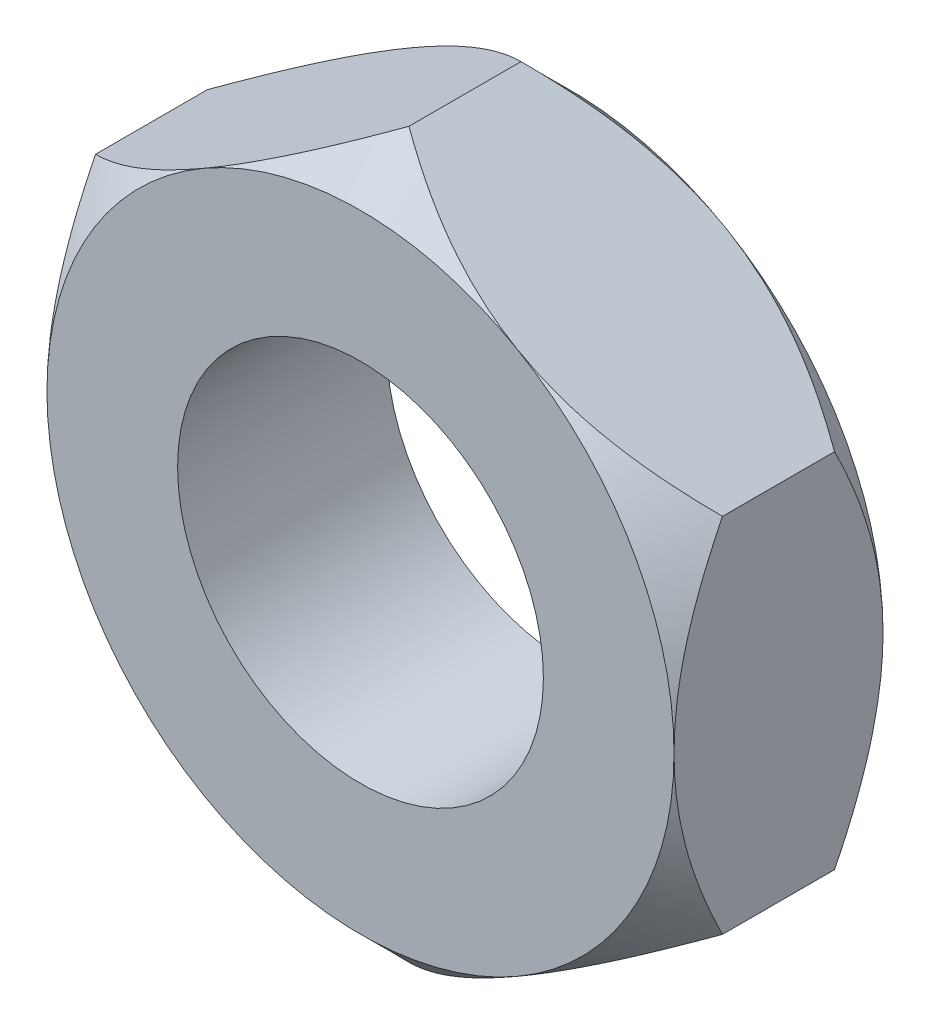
ISO-10303-21;
HEADER;
FILE_DESCRIPTION(('STEP AP214'),'2;1');
FILE_NAME('part.step','',(''),(''),'','','');
FILE_SCHEMA(('AUTOMOTIVE_DESIGN { 1 0 10303 214 1 1 1 1 }'));
ENDSEC;
DATA;
#1=APPLICATION_CONTEXT('core data for automotive mechanical design processes');
#2=APPLICATION_PROTOCOL_DEFINITION('international standard','automotive_design',2000,#1);
#3=PRODUCT_CONTEXT('',#1,'mechanical');
#4=PRODUCT('Part','Part','',(#3));
#5=PRODUCT_RELATED_PRODUCT_CATEGORY('part','',(#4));
#6=PRODUCT_DEFINITION_FORMATION('','',#4);
#7=PRODUCT_DEFINITION_CONTEXT('part definition',#1,'design');
#8=PRODUCT_DEFINITION('design','',#6,#7);
#9=PRODUCT_DEFINITION_SHAPE('','',#8);
#10=(LENGTH_UNIT() NAMED_UNIT(*) SI_UNIT(.MILLI.,.METRE.));
#11=(NAMED_UNIT(*) PLANE_ANGLE_UNIT() SI_UNIT($,.RADIAN.));
#12=(NAMED_UNIT(*) SI_UNIT($,.STERADIAN.) SOLID_ANGLE_UNIT());
#13=UNCERTAINTY_MEASURE_WITH_UNIT(LENGTH_MEASURE(1.E-05),#10,'distance_accuracy_value','');
#14=(GEOMETRIC_REPRESENTATION_CONTEXT(3) GLOBAL_UNCERTAINTY_ASSIGNED_CONTEXT((#13)) GLOBAL_UNIT_ASSIGNED_CONTEXT((#10,
#11,#12)) REPRESENTATION_CONTEXT('',''));
#15=CARTESIAN_POINT('',(0.,0.,0.));
#16=DIRECTION('',(0.,0.,1.));
#17=DIRECTION('',(1.,0.,0.));
#18=AXIS2_PLACEMENT_3D('',#15,#16,#17);
#19=CARTESIAN_POINT('',(0.,17.3205080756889,10.));
#20=DIRECTION('',(0.5,-0.866025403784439,0.));
#21=DIRECTION('',(0.866025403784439,0.5,0.));
#22=AXIS2_PLACEMENT_3D('',#19,#20,#21);
#23=PLANE('',#22);
#24=DIRECTION('',(0.,0.,-0.999999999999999));
#25=VECTOR('',#24,1.);
#26=CARTESIAN_POINT('',(0.,17.3205080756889,10.));
#27=LINE('',#26,#25);
#28=CARTESIAN_POINT('',(0.,17.3205080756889,7.67949192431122));
#29=VERTEX_POINT('',#28);
#30=CARTESIAN_POINT('',(0.,17.3205080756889,2.32050807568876));
#31=VERTEX_POINT('',#30);
#32=EDGE_CURVE('E195',#29,#31,#27,.T.);
#33=ORIENTED_EDGE('',*,*,#32,.T.);
#34=CARTESIAN_POINT('',(0.000200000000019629,17.3206235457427,2.3206235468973));
#35=CARTESIAN_POINT('',(-0.257681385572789,17.1717356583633,2.17175837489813));
#36=CARTESIAN_POINT('',(-0.517582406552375,17.021681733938,2.02743581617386));
#37=CARTESIAN_POINT('',(-1.04173802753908,16.7190603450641,1.74931885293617));
#38=CARTESIAN_POINT('',(-1.3059949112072,16.5664915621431,1.61553019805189));
#39=CARTESIAN_POINT('',(-1.84042292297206,16.2579394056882,1.35935739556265));
#40=CARTESIAN_POINT('',(-2.1106192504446,16.1019414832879,1.237042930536));
#41=CARTESIAN_POINT('',(-2.65544989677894,15.787383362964,1.00647508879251));
#42=CARTESIAN_POINT('',(-2.93008352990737,15.6288235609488,0.898219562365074));
#43=CARTESIAN_POINT('',(-3.47937236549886,15.3116915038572,0.699194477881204));
#44=CARTESIAN_POINT('',(-3.75396008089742,15.1531582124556,0.6081779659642));
#45=CARTESIAN_POINT('',(-4.30698719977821,14.8338678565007,0.443401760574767));
#46=CARTESIAN_POINT('',(-4.58542618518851,14.6731110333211,0.369640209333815));
#47=CARTESIAN_POINT('',(-5.1449529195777,14.3500681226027,0.241227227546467));
#48=CARTESIAN_POINT('',(-5.42603321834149,14.1877863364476,0.18653278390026));
#49=CARTESIAN_POINT('',(-5.99058876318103,13.861840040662,0.0974695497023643));
#50=CARTESIAN_POINT('',(-6.27406364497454,13.69817574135,0.0630977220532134));
#51=CARTESIAN_POINT('',(-6.76149995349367,13.4167542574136,0.022392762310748));
#52=CARTESIAN_POINT('',(-6.96514556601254,13.2991794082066,0.0108654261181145));
#53=CARTESIAN_POINT('',(-7.37269813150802,13.0638788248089,-0.00112365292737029));
#54=CARTESIAN_POINT('',(-7.57660509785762,12.9461530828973,-0.00158480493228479));
#55=CARTESIAN_POINT('',(-7.9842660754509,12.7107899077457,0.00857457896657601));
#56=CARTESIAN_POINT('',(-8.18802003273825,12.5931525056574,0.0191980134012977));
#57=CARTESIAN_POINT('',(-8.59488853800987,12.3582468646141,0.051358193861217));
#58=CARTESIAN_POINT('',(-8.79800301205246,12.2409786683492,0.0728961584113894));
#59=CARTESIAN_POINT('',(-9.40614978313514,11.8898649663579,0.153499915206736));
#60=CARTESIAN_POINT('',(-9.80966047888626,11.6568979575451,0.2285467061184));
#61=CARTESIAN_POINT('',(-10.6096804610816,11.1950062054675,0.417154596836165));
#62=CARTESIAN_POINT('',(-11.0061902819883,10.9660811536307,0.530712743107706));
#63=CARTESIAN_POINT('',(-11.7100552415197,10.5597045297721,0.764324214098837));
#64=CARTESIAN_POINT('',(-12.0189658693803,10.3813548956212,0.878232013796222));
#65=CARTESIAN_POINT('',(-12.6312390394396,10.0278588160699,1.12440235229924));
#66=CARTESIAN_POINT('',(-12.9346014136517,9.85271246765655,1.25666544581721));
#67=CARTESIAN_POINT('',(-13.5348267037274,9.50617223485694,1.53658144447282));
#68=CARTESIAN_POINT('',(-13.8317066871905,9.33476849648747,1.68418594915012));
#69=CARTESIAN_POINT('',(-14.4199697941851,8.99513463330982,1.9928473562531));
#70=CARTESIAN_POINT('',(-14.711356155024,8.82690263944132,2.15389601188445));
#71=CARTESIAN_POINT('',(-15.0002,8.66013856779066,2.3206235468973));
#72=B_SPLINE_CURVE_WITH_KNOTS('',3,(#34,#35,#36,#37,#38,#39,#40,#41,#42,#43,#44,#45,#46,#47,#48,
#49,#50,#51,#52,#53,#54,#55,#56,#57,#58,#59,#60,#61,#62,#63,#64,#65,#66,#67,#68,#69,#70,#71),
.UNSPECIFIED.,.F.,.F.,(4,2,2,2,2,2,2,2,2,2,2,2,2,2,2,2,2,2,4),(0.,0.998782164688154,
1.99810576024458,3.00315100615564,4.00804239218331,4.9972205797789,5.98629221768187,
6.97311796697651,7.9597962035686,8.66585059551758,9.3719426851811,10.0782194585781,
10.7845750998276,12.1984080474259,13.6121325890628,14.734933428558,15.8577682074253,
16.9771623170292,18.0958747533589),.UNSPECIFIED.);
#73=CARTESIAN_POINT('',(-7.50000000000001,12.9903810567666,0.));
#74=VERTEX_POINT('',#73);
#75=EDGE_CURVE('E48',#31,#74,#72,.T.);
#76=ORIENTED_EDGE('',*,*,#75,.T.);
#77=CARTESIAN_POINT('',(-15.,8.66025403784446,2.32050807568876));
#78=VERTEX_POINT('',#77);
#79=EDGE_CURVE('E143',#74,#78,#72,.T.);
#80=ORIENTED_EDGE('',*,*,#79,.T.);
#81=DIRECTION('',(0.,0.,-0.999999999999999));
#82=VECTOR('',#81,1.);
#83=CARTESIAN_POINT('',(-15.,8.66025403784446,10.));
#84=LINE('',#83,#82);
#85=CARTESIAN_POINT('',(-15.,8.66025403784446,7.67949192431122));
#86=VERTEX_POINT('',#85);
#87=EDGE_CURVE('E154',#86,#78,#84,.T.);
#88=ORIENTED_EDGE('',*,*,#87,.F.);
#89=CARTESIAN_POINT('',(0.000200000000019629,17.3206235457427,7.67937645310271));
#90=CARTESIAN_POINT('',(-0.25768138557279,17.1717356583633,7.82824162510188));
#91=CARTESIAN_POINT('',(-0.517582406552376,17.021681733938,7.97256418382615));
#92=CARTESIAN_POINT('',(-1.04173802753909,16.7190603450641,8.25068114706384));
#93=CARTESIAN_POINT('',(-1.3059949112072,16.5664915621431,8.38446980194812));
#94=CARTESIAN_POINT('',(-1.84042292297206,16.2579394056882,8.64064260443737));
#95=CARTESIAN_POINT('',(-2.11061925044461,16.1019414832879,8.76295706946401));
#96=CARTESIAN_POINT('',(-2.65544989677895,15.787383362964,8.9935249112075));
#97=CARTESIAN_POINT('',(-2.93008352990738,15.6288235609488,9.10178043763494));
#98=CARTESIAN_POINT('',(-3.47937236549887,15.3116915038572,9.30080552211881));
#99=CARTESIAN_POINT('',(-3.75396008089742,15.1531582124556,9.39182203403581));
#100=CARTESIAN_POINT('',(-4.30698719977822,14.8338678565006,9.55659823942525));
#101=CARTESIAN_POINT('',(-4.58542618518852,14.6731110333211,9.6303597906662));
#102=CARTESIAN_POINT('',(-5.14495291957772,14.3500681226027,9.75877277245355));
#103=CARTESIAN_POINT('',(-5.4260332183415,14.1877863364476,9.81346721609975));
#104=CARTESIAN_POINT('',(-5.99058876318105,13.8618400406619,9.90253045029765));
#105=CARTESIAN_POINT('',(-6.27406364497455,13.69817574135,9.93690227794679));
#106=CARTESIAN_POINT('',(-6.76149995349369,13.4167542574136,9.97760723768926));
#107=CARTESIAN_POINT('',(-6.96514556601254,13.2991794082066,9.98913457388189));
#108=CARTESIAN_POINT('',(-7.37269813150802,13.0638788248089,10.0011236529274));
#109=CARTESIAN_POINT('',(-7.57660509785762,12.9461530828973,10.0015848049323));
#110=CARTESIAN_POINT('',(-7.9842660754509,12.7107899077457,9.99142542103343));
#111=CARTESIAN_POINT('',(-8.18802003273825,12.5931525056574,9.98080198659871));
#112=CARTESIAN_POINT('',(-8.59488853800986,12.3582468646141,9.94864180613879));
#113=CARTESIAN_POINT('',(-8.79800301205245,12.2409786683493,9.92710384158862));
#114=CARTESIAN_POINT('',(-9.40614978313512,11.8898649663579,9.84650008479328));
#115=CARTESIAN_POINT('',(-9.80966047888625,11.6568979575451,9.77145329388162));
#116=CARTESIAN_POINT('',(-10.6096804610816,11.1950062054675,9.58284540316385));
#117=CARTESIAN_POINT('',(-11.0061902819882,10.9660811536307,9.4692872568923));
#118=CARTESIAN_POINT('',(-11.7100552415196,10.5597045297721,9.23567578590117));
#119=CARTESIAN_POINT('',(-12.0189658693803,10.3813548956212,9.12176798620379));
#120=CARTESIAN_POINT('',(-12.6312390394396,10.0278588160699,8.87559764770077));
#121=CARTESIAN_POINT('',(-12.9346014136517,9.85271246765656,8.74333455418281));
#122=CARTESIAN_POINT('',(-13.5348267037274,9.50617223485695,8.46341855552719));
#123=CARTESIAN_POINT('',(-13.8317066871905,9.33476849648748,8.3158140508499));
#124=CARTESIAN_POINT('',(-14.4199697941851,8.99513463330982,8.00715264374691));
#125=CARTESIAN_POINT('',(-14.711356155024,8.82690263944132,7.84610398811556));
#126=CARTESIAN_POINT('',(-15.0002,8.66013856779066,7.67937645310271));
#127=B_SPLINE_CURVE_WITH_KNOTS('',3,(#89,#90,#91,#92,#93,#94,#95,#96,#97,#98,#99,#100,#101,#102,
#103,#104,#105,#106,#107,#108,#109,#110,#111,#112,#113,#114,#115,#116,#117,#118,#119,#120,#121,
#122,#123,#124,#125,#126),.UNSPECIFIED.,.F.,.F.,(4,2,2,2,2,2,2,2,2,2,2,2,2,2,2,2,2,2,4),(0.,
0.998782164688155,1.99810576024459,3.00315100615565,4.00804239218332,4.99722057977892,
5.98629221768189,6.97311796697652,7.95979620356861,8.66585059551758,9.3719426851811,
10.0782194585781,10.7845750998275,12.1984080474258,13.6121325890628,14.734933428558,
15.8577682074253,16.9771623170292,18.0958747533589),.UNSPECIFIED.);
#128=CARTESIAN_POINT('',(-7.50000000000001,12.9903810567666,10.));
#129=VERTEX_POINT('',#128);
#130=EDGE_CURVE('E232',#129,#86,#127,.T.);
#131=ORIENTED_EDGE('',*,*,#130,.F.);
#132=EDGE_CURVE('E223',#29,#129,#127,.T.);
#133=ORIENTED_EDGE('',*,*,#132,.F.);
#134=EDGE_LOOP('',(#33,#76,#80,#88,#131,#133));
#135=FACE_BOUND('',#134,.T.);
#136=ADVANCED_FACE('F32',(#135),#23,.F.);
#137=CARTESIAN_POINT('',(-15.,8.66025403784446,10.));
#138=DIRECTION('',(1.,0.,0.));
#139=DIRECTION('',(0.,0.,-0.999999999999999));
#140=AXIS2_PLACEMENT_3D('',#137,#138,#139);
#141=PLANE('',#140);
#142=ORIENTED_EDGE('',*,*,#87,.T.);
#143=CARTESIAN_POINT('',(-15.,-21.8879460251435,11.5345469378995));
#144=CARTESIAN_POINT('',(-15.,-21.6125220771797,11.3073579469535));
#145=CARTESIAN_POINT('',(-15.,-21.3364301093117,11.0809794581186));
#146=CARTESIAN_POINT('',(-15.,-20.7827757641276,10.630020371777));
#147=CARTESIAN_POINT('',(-15.,-20.5052133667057,10.4054397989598));
#148=CARTESIAN_POINT('',(-15.,-19.6699971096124,9.73456260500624));
#149=CARTESIAN_POINT('',(-15.,-19.109945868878,9.29123940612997));
#150=CARTESIAN_POINT('',(-15.,-17.9759791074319,8.40955530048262));
#151=CARTESIAN_POINT('',(-15.,-17.4019787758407,7.97130330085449));
#152=CARTESIAN_POINT('',(-15.,-16.2445936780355,7.10742602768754));
#153=CARTESIAN_POINT('',(-15.,-15.6612098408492,6.68179951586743));
#154=CARTESIAN_POINT('',(-15.,-14.7489977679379,6.03523674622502));
#155=CARTESIAN_POINT('',(-15.,-14.4241697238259,5.80865299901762));
#156=CARTESIAN_POINT('',(-15.,-13.7706695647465,5.36110486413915));
#157=CARTESIAN_POINT('',(-15.,-13.4419975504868,5.14014032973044));
#158=CARTESIAN_POINT('',(-15.,-12.7802398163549,4.70463012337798));
#159=CARTESIAN_POINT('',(-15.,-12.4471524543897,4.49008694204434));
#160=CARTESIAN_POINT('',(-15.,-11.7762073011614,4.06858468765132));
#161=CARTESIAN_POINT('',(-15.,-11.438349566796,3.86162552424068));
#162=CARTESIAN_POINT('',(-15.,-10.7589256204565,3.45752537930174));
#163=CARTESIAN_POINT('',(-15.,-10.4173839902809,3.26034318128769));
#164=CARTESIAN_POINT('',(-15.,-9.72850365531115,2.8762973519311));
#165=CARTESIAN_POINT('',(-15.,-9.38116464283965,2.68943427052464));
#166=CARTESIAN_POINT('',(-15.,-8.68044428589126,2.32801448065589));
#167=CARTESIAN_POINT('',(-15.,-8.32706760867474,2.15344875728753));
#168=CARTESIAN_POINT('',(-15.,-7.61361288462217,1.81867650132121));
#169=CARTESIAN_POINT('',(-15.,-7.25353607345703,1.65846735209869));
#170=CARTESIAN_POINT('',(-15.,-6.63408029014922,1.39990912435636));
#171=CARTESIAN_POINT('',(-15.,-6.37648295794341,1.29729800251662));
#172=CARTESIAN_POINT('',(-15.,-5.85778037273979,1.10142418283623));
#173=CARTESIAN_POINT('',(-15.,-5.59667514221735,1.00816142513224));
#174=CARTESIAN_POINT('',(-15.,-4.80794039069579,0.74392529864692));
#175=CARTESIAN_POINT('',(-15.,-4.27487990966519,0.588499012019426));
#176=CARTESIAN_POINT('',(-15.,-3.47238861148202,0.394544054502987));
#177=CARTESIAN_POINT('',(-15.,-3.20748106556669,0.336872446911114));
#178=CARTESIAN_POINT('',(-15.,-2.67519311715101,0.234451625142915));
#179=CARTESIAN_POINT('',(-15.,-2.40781314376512,0.189700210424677));
#180=CARTESIAN_POINT('',(-15.,-1.87113801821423,0.113920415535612));
#181=CARTESIAN_POINT('',(-15.,-1.60184305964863,0.0828906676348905));
#182=CARTESIAN_POINT('',(-15.,-1.06198212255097,0.0351432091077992));
#183=CARTESIAN_POINT('',(-15.,-0.791416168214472,0.0184252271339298));
#184=CARTESIAN_POINT('',(-15.,-0.264584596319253,0.000151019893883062));
#185=CARTESIAN_POINT('',(-15.,-0.00834580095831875,-0.00218408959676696));
#186=CARTESIAN_POINT('',(-15.,0.503911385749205,0.00627689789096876));
#187=CARTESIAN_POINT('',(-15.,0.759929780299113,0.0170728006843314));
#188=CARTESIAN_POINT('',(-15.,1.27108281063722,0.0515988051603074));
#189=CARTESIAN_POINT('',(-15.,1.52621746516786,0.0753286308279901));
#190=CARTESIAN_POINT('',(-15.,2.03503902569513,0.135307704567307));
#191=CARTESIAN_POINT('',(-15.,2.288725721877,0.17155872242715));
#192=CARTESIAN_POINT('',(-15.,2.79896380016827,0.256792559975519));
#193=CARTESIAN_POINT('',(-15.,3.05547641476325,0.306006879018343));
#194=CARTESIAN_POINT('',(-15.,3.56601371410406,0.416039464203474));
#195=CARTESIAN_POINT('',(-15.,3.82003804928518,0.476859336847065));
#196=CARTESIAN_POINT('',(-15.,4.57776457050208,0.675409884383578));
#197=CARTESIAN_POINT('',(-15.,5.07729432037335,0.829261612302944));
#198=CARTESIAN_POINT('',(-15.,6.07260401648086,1.17574033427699));
#199=CARTESIAN_POINT('',(-15.,6.56815275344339,1.36901828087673));
#200=CARTESIAN_POINT('',(-15.,7.54661600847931,1.78556959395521));
#201=CARTESIAN_POINT('',(-15.,8.0295249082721,2.00885603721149));
#202=CARTESIAN_POINT('',(-15.,8.98488851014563,2.48013151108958));
#203=CARTESIAN_POINT('',(-15.,9.4573062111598,2.72819489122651));
#204=CARTESIAN_POINT('',(-15.,10.3913526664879,3.24358931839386));
#205=CARTESIAN_POINT('',(-15.,10.8529830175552,3.51091748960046));
#206=CARTESIAN_POINT('',(-15.,11.7442553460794,4.04750167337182));
#207=CARTESIAN_POINT('',(-15.,12.1743504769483,4.3160089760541));
#208=CARTESIAN_POINT('',(-15.,13.0271509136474,4.86454324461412));
#209=CARTESIAN_POINT('',(-15.,13.4498556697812,5.14457106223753));
#210=CARTESIAN_POINT('',(-15.,14.2854740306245,5.71186670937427));
#211=CARTESIAN_POINT('',(-15.,14.6984387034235,5.99905949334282));
#212=CARTESIAN_POINT('',(-15.,15.313664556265,6.43565941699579));
#213=CARTESIAN_POINT('',(-15.,15.5180104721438,6.58214209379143));
#214=CARTESIAN_POINT('',(-15.,15.9254010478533,6.87689756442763));
#215=CARTESIAN_POINT('',(-15.,16.1284457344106,7.02517032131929));
#216=CARTESIAN_POINT('',(-15.,16.330887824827,7.17426204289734));
#217=B_SPLINE_CURVE_WITH_KNOTS('',3,(#143,#144,#145,#146,#147,#148,#149,#150,#151,#152,#153,
#154,#155,#156,#157,#158,#159,#160,#161,#162,#163,#164,#165,#166,#167,#168,#169,#170,#171,#172,
#173,#174,#175,#176,#177,#178,#179,#180,#181,#182,#183,#184,#185,#186,#187,#188,#189,#190,#191,
#192,#193,#194,#195,#196,#197,#198,#199,#200,#201,#202,#203,#204,#205,#206,#207,#208,#209,#210,
#211,#212,#213,#214,#215,#216),.UNSPECIFIED.,.F.,.F.,(4,2,2,2,2,2,2,2,2,2,2,2,2,2,2,2,2,2,2,2,2,
2,2,2,2,2,2,2,2,2,2,2,2,2,2,2,4),(0.,1.07109844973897,2.14221158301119,4.2849504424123,
6.45135828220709,8.61755293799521,9.80564754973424,10.9937111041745,12.1822296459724,
13.3707340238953,14.5537062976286,15.7367415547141,16.9189003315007,18.1008432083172,
18.9325141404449,19.7641797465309,21.4274722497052,22.2405576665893,23.0535045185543,
23.8663703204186,24.6792207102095,25.4476351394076,26.2160382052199,26.9844248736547,
27.7529201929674,28.5361985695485,29.3195854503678,30.8858311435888,32.4804034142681,
34.0756728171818,35.6758818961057,37.275852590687,38.7967227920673,40.3177056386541,
41.8266241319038,42.5808906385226,43.3351416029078),.UNSPECIFIED.);
#218=CARTESIAN_POINT('',(-15.,0.,0.));
#219=VERTEX_POINT('',#218);
#220=EDGE_CURVE('E137',#78,#219,#217,.F.);
#221=ORIENTED_EDGE('',*,*,#220,.T.);
#222=CARTESIAN_POINT('',(-15.,-8.66025403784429,2.32050807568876));
#223=VERTEX_POINT('',#222);
#224=EDGE_CURVE('E125',#219,#223,#217,.F.);
#225=ORIENTED_EDGE('',*,*,#224,.T.);
#226=DIRECTION('',(0.,0.,-0.999999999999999));
#227=VECTOR('',#226,1.);
#228=CARTESIAN_POINT('',(-15.,-8.66025403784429,10.));
#229=LINE('',#228,#227);
#230=CARTESIAN_POINT('',(-15.,-8.66025403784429,7.67949192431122));
#231=VERTEX_POINT('',#230);
#232=EDGE_CURVE('E305',#231,#223,#229,.T.);
#233=ORIENTED_EDGE('',*,*,#232,.F.);
#234=CARTESIAN_POINT('',(-15.,-21.8879460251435,-1.53454693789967));
#235=CARTESIAN_POINT('',(-15.,-21.6125220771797,-1.30735794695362));
#236=CARTESIAN_POINT('',(-15.,-21.3364301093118,-1.08097945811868));
#237=CARTESIAN_POINT('',(-15.,-20.7827757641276,-0.630020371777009));
#238=CARTESIAN_POINT('',(-15.,-20.5052133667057,-0.405439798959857));
#239=CARTESIAN_POINT('',(-15.,-19.6699971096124,0.265437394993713));
#240=CARTESIAN_POINT('',(-15.,-19.1099458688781,0.708760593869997));
#241=CARTESIAN_POINT('',(-15.,-17.9759791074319,1.59044469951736));
#242=CARTESIAN_POINT('',(-15.,-17.4019787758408,2.02869669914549));
#243=CARTESIAN_POINT('',(-15.,-16.2445936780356,2.89257397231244));
#244=CARTESIAN_POINT('',(-15.,-15.6612098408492,3.31820048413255));
#245=CARTESIAN_POINT('',(-15.,-14.7489977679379,3.96476325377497));
#246=CARTESIAN_POINT('',(-15.,-14.4241697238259,4.19134700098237));
#247=CARTESIAN_POINT('',(-15.,-13.7706695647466,4.63889513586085));
#248=CARTESIAN_POINT('',(-15.,-13.4419975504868,4.85985967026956));
#249=CARTESIAN_POINT('',(-15.,-12.7802398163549,5.29536987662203));
#250=CARTESIAN_POINT('',(-15.,-12.4471524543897,5.50991305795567));
#251=CARTESIAN_POINT('',(-15.,-11.7762073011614,5.93141531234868));
#252=CARTESIAN_POINT('',(-15.,-11.438349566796,6.13837447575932));
#253=CARTESIAN_POINT('',(-15.,-10.7589256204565,6.54247462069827));
#254=CARTESIAN_POINT('',(-15.,-10.4173839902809,6.73965681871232));
#255=CARTESIAN_POINT('',(-15.,-9.72850365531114,7.12370264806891));
#256=CARTESIAN_POINT('',(-15.,-9.38116464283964,7.31056572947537));
#257=CARTESIAN_POINT('',(-15.,-8.68044428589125,7.67198551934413));
#258=CARTESIAN_POINT('',(-15.,-8.32706760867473,7.8465512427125));
#259=CARTESIAN_POINT('',(-15.,-7.61361288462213,8.1813234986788));
#260=CARTESIAN_POINT('',(-15.,-7.25353607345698,8.34153264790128));
#261=CARTESIAN_POINT('',(-15.,-6.63408029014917,8.60009087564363));
#262=CARTESIAN_POINT('',(-15.,-6.37648295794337,8.70270199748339));
#263=CARTESIAN_POINT('',(-15.,-5.85778037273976,8.8985758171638));
#264=CARTESIAN_POINT('',(-15.,-5.59667514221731,8.99183857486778));
#265=CARTESIAN_POINT('',(-15.,-4.80794039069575,9.25607470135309));
#266=CARTESIAN_POINT('',(-15.,-4.27487990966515,9.41150098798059));
#267=CARTESIAN_POINT('',(-15.,-3.47238861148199,9.60545594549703));
#268=CARTESIAN_POINT('',(-15.,-3.20748106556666,9.66312755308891));
#269=CARTESIAN_POINT('',(-15.,-2.67519311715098,9.7655483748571));
#270=CARTESIAN_POINT('',(-15.,-2.40781314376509,9.81029978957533));
#271=CARTESIAN_POINT('',(-15.,-1.8711380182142,9.8860795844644));
#272=CARTESIAN_POINT('',(-15.,-1.60184305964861,9.91710933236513));
#273=CARTESIAN_POINT('',(-15.,-1.06198212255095,9.9648567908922));
#274=CARTESIAN_POINT('',(-14.9999999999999,-0.791416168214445,9.98157477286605));
#275=CARTESIAN_POINT('',(-14.9999999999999,-0.264584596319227,9.9998489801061));
#276=CARTESIAN_POINT('',(-15.,-0.00834580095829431,10.0021840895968));
#277=CARTESIAN_POINT('',(-15.,0.503911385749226,9.99372310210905));
#278=CARTESIAN_POINT('',(-15.,0.759929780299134,9.98292719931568));
#279=CARTESIAN_POINT('',(-15.,1.27108281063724,9.9484011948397));
#280=CARTESIAN_POINT('',(-15.,1.52621746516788,9.92467136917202));
#281=CARTESIAN_POINT('',(-15.,2.03503902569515,9.8646922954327));
#282=CARTESIAN_POINT('',(-15.,2.28872572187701,9.82844127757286));
#283=CARTESIAN_POINT('',(-15.,2.79896380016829,9.74320744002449));
#284=CARTESIAN_POINT('',(-15.,3.05547641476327,9.69399312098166));
#285=CARTESIAN_POINT('',(-15.,3.56601371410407,9.58396053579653));
#286=CARTESIAN_POINT('',(-15.,3.82003804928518,9.52314066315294));
#287=CARTESIAN_POINT('',(-15.,4.57776457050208,9.32459011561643));
#288=CARTESIAN_POINT('',(-15.,5.07729432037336,9.17073838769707));
#289=CARTESIAN_POINT('',(-15.,6.07260401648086,8.82425966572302));
#290=CARTESIAN_POINT('',(-15.,6.56815275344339,8.63098171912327));
#291=CARTESIAN_POINT('',(-15.,7.54661600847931,8.2144304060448));
#292=CARTESIAN_POINT('',(-15.,8.0295249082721,7.99114396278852));
#293=CARTESIAN_POINT('',(-15.,8.98488851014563,7.51986848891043));
#294=CARTESIAN_POINT('',(-15.,9.4573062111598,7.27180510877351));
#295=CARTESIAN_POINT('',(-15.,10.3913526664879,6.75641068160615));
#296=CARTESIAN_POINT('',(-15.,10.8529830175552,6.48908251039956));
#297=CARTESIAN_POINT('',(-15.,11.7442553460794,5.95249832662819));
#298=CARTESIAN_POINT('',(-15.,12.1743504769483,5.68399102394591));
#299=CARTESIAN_POINT('',(-15.,13.0271509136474,5.1354567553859));
#300=CARTESIAN_POINT('',(-15.,13.4498556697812,4.85542893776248));
#301=CARTESIAN_POINT('',(-15.,14.2854740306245,4.28813329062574));
#302=CARTESIAN_POINT('',(-15.,14.6984387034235,4.00094050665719));
#303=CARTESIAN_POINT('',(-15.,15.313664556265,3.56434058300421));
#304=CARTESIAN_POINT('',(-15.,15.5180104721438,3.41785790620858));
#305=CARTESIAN_POINT('',(-15.,15.9254010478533,3.12310243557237));
#306=CARTESIAN_POINT('',(-15.,16.1284457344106,2.97482967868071));
#307=CARTESIAN_POINT('',(-15.,16.330887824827,2.82573795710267));
#308=B_SPLINE_CURVE_WITH_KNOTS('',3,(#234,#235,#236,#237,#238,#239,#240,#241,#242,#243,#244,
#245,#246,#247,#248,#249,#250,#251,#252,#253,#254,#255,#256,#257,#258,#259,#260,#261,#262,#263,
#264,#265,#266,#267,#268,#269,#270,#271,#272,#273,#274,#275,#276,#277,#278,#279,#280,#281,#282,
#283,#284,#285,#286,#287,#288,#289,#290,#291,#292,#293,#294,#295,#296,#297,#298,#299,#300,#301,
#302,#303,#304,#305,#306,#307),.UNSPECIFIED.,.F.,.F.,(4,2,2,2,2,2,2,2,2,2,2,2,2,2,2,2,2,2,2,2,2,
2,2,2,2,2,2,2,2,2,2,2,2,2,2,2,4),(0.,1.07109844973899,2.14221158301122,4.28495044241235,
6.45135828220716,8.61755293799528,9.80564754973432,10.9937111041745,12.1822296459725,
13.3707340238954,14.5537062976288,15.7367415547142,16.9189003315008,18.1008432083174,
18.9325141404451,19.764179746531,21.4274722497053,22.2405576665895,23.0535045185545,
23.8663703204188,24.6792207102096,25.4476351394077,26.21603820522,26.9844248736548,
27.7529201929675,28.5361985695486,29.3195854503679,30.8858311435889,32.4804034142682,
34.0756728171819,35.6758818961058,37.2758525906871,38.7967227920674,40.3177056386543,
41.826624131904,42.5808906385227,43.335141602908),.UNSPECIFIED.);
#309=CARTESIAN_POINT('',(-15.,0.,10.));
#310=VERTEX_POINT('',#309);
#311=EDGE_CURVE('E182',#310,#231,#308,.F.);
#312=ORIENTED_EDGE('',*,*,#311,.F.);
#313=EDGE_CURVE('E188',#86,#310,#308,.F.);
#314=ORIENTED_EDGE('',*,*,#313,.F.);
#315=EDGE_LOOP('',(#142,#221,#225,#233,#312,#314));
#316=FACE_BOUND('',#315,.T.);
#317=ADVANCED_FACE('F151',(#316),#141,.F.);
#318=CARTESIAN_POINT('',(-15.,-8.66025403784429,10.));
#319=DIRECTION('',(0.5,0.866025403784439,0.));
#320=DIRECTION('',(-0.866025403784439,0.5,0.));
#321=AXIS2_PLACEMENT_3D('',#318,#319,#320);
#322=PLANE('',#321);
#323=ORIENTED_EDGE('',*,*,#232,.T.);
#324=CARTESIAN_POINT('',(-15.0002,-8.66013856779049,2.3206235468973));
#325=CARTESIAN_POINT('',(-14.7423186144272,-8.80902645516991,2.17175837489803));
#326=CARTESIAN_POINT('',(-14.4824175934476,-8.95908037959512,2.02743581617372));
#327=CARTESIAN_POINT('',(-13.9582619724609,-9.26170176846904,1.749318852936));
#328=CARTESIAN_POINT('',(-13.6940050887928,-9.41427055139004,1.61553019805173));
#329=CARTESIAN_POINT('',(-13.1595770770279,-9.72282270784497,1.35935739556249));
#330=CARTESIAN_POINT('',(-12.8893807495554,-9.87882063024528,1.23704293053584));
#331=CARTESIAN_POINT('',(-12.3445501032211,-10.1933787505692,1.00647508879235));
#332=CARTESIAN_POINT('',(-12.0699164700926,-10.3519385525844,0.898219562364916));
#333=CARTESIAN_POINT('',(-11.5206276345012,-10.669070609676,0.699194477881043));
#334=CARTESIAN_POINT('',(-11.2460399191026,-10.8276039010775,0.608177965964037));
#335=CARTESIAN_POINT('',(-10.6930128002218,-11.1468942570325,0.44340176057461));
#336=CARTESIAN_POINT('',(-10.4145738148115,-11.307651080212,0.369640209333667));
#337=CARTESIAN_POINT('',(-9.85504708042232,-11.6306939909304,0.241227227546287));
#338=CARTESIAN_POINT('',(-9.57396678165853,-11.7929757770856,0.186532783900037));
#339=CARTESIAN_POINT('',(-9.00941123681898,-12.1189220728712,0.097469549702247));
#340=CARTESIAN_POINT('',(-8.72593635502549,-12.2825863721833,0.0630977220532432));
#341=CARTESIAN_POINT('',(-8.23850004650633,-12.5640078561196,0.0223927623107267));
#342=CARTESIAN_POINT('',(-8.03485443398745,-12.6815827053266,0.0108654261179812));
#343=CARTESIAN_POINT('',(-7.62730186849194,-12.9168832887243,-0.00112365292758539));
#344=CARTESIAN_POINT('',(-7.42339490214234,-13.0346090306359,-0.00158480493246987));
#345=CARTESIAN_POINT('',(-7.01573392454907,-13.2699722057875,0.0085745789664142));
#346=CARTESIAN_POINT('',(-6.81197996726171,-13.3876096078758,0.019198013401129));
#347=CARTESIAN_POINT('',(-6.40511146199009,-13.6225152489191,0.0513581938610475));
#348=CARTESIAN_POINT('',(-6.2019969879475,-13.7397834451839,0.0728961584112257));
#349=CARTESIAN_POINT('',(-5.59385021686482,-14.0908971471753,0.153499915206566));
#350=CARTESIAN_POINT('',(-5.19033952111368,-14.3238641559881,0.228546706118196));
#351=CARTESIAN_POINT('',(-4.39031953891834,-14.7857559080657,0.417154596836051));
#352=CARTESIAN_POINT('',(-3.99380971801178,-15.0146809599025,0.530712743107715));
#353=CARTESIAN_POINT('',(-3.28994475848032,-15.4210575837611,0.764324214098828));
#354=CARTESIAN_POINT('',(-2.98103413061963,-15.599407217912,0.878232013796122));
#355=CARTESIAN_POINT('',(-2.36876096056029,-15.9529032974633,1.12440235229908));
#356=CARTESIAN_POINT('',(-2.06539858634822,-16.1280496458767,1.25666544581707));
#357=CARTESIAN_POINT('',(-1.46517329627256,-16.4745898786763,1.5365814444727));
#358=CARTESIAN_POINT('',(-1.1682933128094,-16.6459936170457,1.68418594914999));
#359=CARTESIAN_POINT('',(-0.580030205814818,-16.9856274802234,1.99284735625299));
#360=CARTESIAN_POINT('',(-0.288643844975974,-17.1538594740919,2.15389601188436));
#361=CARTESIAN_POINT('',(0.000199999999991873,-17.3206235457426,2.3206235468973));
#362=B_SPLINE_CURVE_WITH_KNOTS('',3,(#324,#325,#326,#327,#328,#329,#330,#331,#332,#333,#334,
#335,#336,#337,#338,#339,#340,#341,#342,#343,#344,#345,#346,#347,#348,#349,#350,#351,#352,#353,
#354,#355,#356,#357,#358,#359,#360,#361),.UNSPECIFIED.,.F.,.F.,(4,2,2,2,2,2,2,2,2,2,2,2,2,2,2,2,
2,2,4),(0.,0.998782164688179,1.99810576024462,3.00315100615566,4.00804239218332,
4.99722057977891,5.98629221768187,6.97311796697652,7.95979620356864,8.66585059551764,
9.37194268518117,10.0782194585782,10.7845750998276,12.1984080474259,13.6121325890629,
14.7349334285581,15.8577682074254,16.9771623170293,18.095874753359),.UNSPECIFIED.);
#363=CARTESIAN_POINT('',(-7.49999999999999,-12.9903810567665,0.));
#364=VERTEX_POINT('',#363);
#365=EDGE_CURVE('E132',#223,#364,#362,.T.);
#366=ORIENTED_EDGE('',*,*,#365,.T.);
#367=CARTESIAN_POINT('',(0.,-17.3205080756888,2.32050807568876));
#368=VERTEX_POINT('',#367);
#369=EDGE_CURVE('E164',#364,#368,#362,.T.);
#370=ORIENTED_EDGE('',*,*,#369,.T.);
#371=DIRECTION('',(0.,0.,-0.999999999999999));
#372=VECTOR('',#371,1.);
#373=CARTESIAN_POINT('',(0.,-17.3205080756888,10.));
#374=LINE('',#373,#372);
#375=CARTESIAN_POINT('',(0.,-17.3205080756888,7.67949192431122));
#376=VERTEX_POINT('',#375);
#377=EDGE_CURVE('E306',#376,#368,#374,.T.);
#378=ORIENTED_EDGE('',*,*,#377,.F.);
#379=CARTESIAN_POINT('',(-15.0002,-8.66013856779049,7.67937645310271));
#380=CARTESIAN_POINT('',(-14.7423186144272,-8.80902645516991,7.82824162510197));
#381=CARTESIAN_POINT('',(-14.4824175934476,-8.95908037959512,7.97256418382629));
#382=CARTESIAN_POINT('',(-13.9582619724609,-9.26170176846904,8.25068114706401));
#383=CARTESIAN_POINT('',(-13.6940050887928,-9.41427055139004,8.38446980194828));
#384=CARTESIAN_POINT('',(-13.1595770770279,-9.72282270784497,8.64064260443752));
#385=CARTESIAN_POINT('',(-12.8893807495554,-9.87882063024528,8.76295706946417));
#386=CARTESIAN_POINT('',(-12.3445501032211,-10.1933787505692,8.99352491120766));
#387=CARTESIAN_POINT('',(-12.0699164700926,-10.3519385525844,9.10178043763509));
#388=CARTESIAN_POINT('',(-11.5206276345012,-10.669070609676,9.30080552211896));
#389=CARTESIAN_POINT('',(-11.2460399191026,-10.8276039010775,9.39182203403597));
#390=CARTESIAN_POINT('',(-10.6930128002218,-11.1468942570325,9.5565982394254));
#391=CARTESIAN_POINT('',(-10.4145738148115,-11.307651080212,9.63035979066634));
#392=CARTESIAN_POINT('',(-9.85504708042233,-11.6306939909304,9.75877277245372));
#393=CARTESIAN_POINT('',(-9.57396678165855,-11.7929757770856,9.81346721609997));
#394=CARTESIAN_POINT('',(-9.00941123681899,-12.1189220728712,9.90253045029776));
#395=CARTESIAN_POINT('',(-8.72593635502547,-12.2825863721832,9.93690227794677));
#396=CARTESIAN_POINT('',(-8.23850004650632,-12.5640078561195,9.97760723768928));
#397=CARTESIAN_POINT('',(-8.03485443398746,-12.6815827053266,9.98913457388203));
#398=CARTESIAN_POINT('',(-7.62730186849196,-12.9168832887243,10.0011236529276));
#399=CARTESIAN_POINT('',(-7.42339490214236,-13.0346090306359,10.0015848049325));
#400=CARTESIAN_POINT('',(-7.01573392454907,-13.2699722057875,9.99142542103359));
#401=CARTESIAN_POINT('',(-6.81197996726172,-13.3876096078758,9.98080198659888));
#402=CARTESIAN_POINT('',(-6.4051114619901,-13.6225152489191,9.94864180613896));
#403=CARTESIAN_POINT('',(-6.20199698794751,-13.7397834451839,9.92710384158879));
#404=CARTESIAN_POINT('',(-5.59385021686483,-14.0908971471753,9.84650008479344));
#405=CARTESIAN_POINT('',(-5.19033952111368,-14.3238641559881,9.77145329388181));
#406=CARTESIAN_POINT('',(-4.39031953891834,-14.7857559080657,9.58284540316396));
#407=CARTESIAN_POINT('',(-3.99380971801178,-15.0146809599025,9.46928725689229));
#408=CARTESIAN_POINT('',(-3.28994475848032,-15.4210575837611,9.23567578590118));
#409=CARTESIAN_POINT('',(-2.98103413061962,-15.599407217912,9.12176798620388));
#410=CARTESIAN_POINT('',(-2.36876096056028,-15.9529032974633,8.87559764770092));
#411=CARTESIAN_POINT('',(-2.06539858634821,-16.1280496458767,8.74333455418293));
#412=CARTESIAN_POINT('',(-1.46517329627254,-16.4745898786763,8.4634185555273));
#413=CARTESIAN_POINT('',(-1.16829331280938,-16.6459936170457,8.31581405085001));
#414=CARTESIAN_POINT('',(-0.580030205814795,-16.9856274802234,8.00715264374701));
#415=CARTESIAN_POINT('',(-0.288643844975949,-17.1538594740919,7.84610398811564));
#416=CARTESIAN_POINT('',(0.000200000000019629,-17.3206235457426,7.67937645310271));
#417=B_SPLINE_CURVE_WITH_KNOTS('',3,(#379,#380,#381,#382,#383,#384,#385,#386,#387,#388,#389,
#390,#391,#392,#393,#394,#395,#396,#397,#398,#399,#400,#401,#402,#403,#404,#405,#406,#407,#408,
#409,#410,#411,#412,#413,#414,#415,#416),.UNSPECIFIED.,.F.,.F.,(4,2,2,2,2,2,2,2,2,2,2,2,2,2,2,2,
2,2,4),(0.,0.998782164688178,1.99810576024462,3.00315100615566,4.00804239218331,4.9972205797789,
5.98629221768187,6.97311796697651,7.95979620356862,8.66585059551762,9.37194268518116,
10.0782194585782,10.7845750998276,12.1984080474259,13.6121325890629,14.7349334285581,
15.8577682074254,16.9771623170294,18.095874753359),.UNSPECIFIED.);
#418=CARTESIAN_POINT('',(-7.49999999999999,-12.9903810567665,10.));
#419=VERTEX_POINT('',#418);
#420=EDGE_CURVE('E190',#419,#376,#417,.T.);
#421=ORIENTED_EDGE('',*,*,#420,.F.);
#422=EDGE_CURVE('E189',#231,#419,#417,.T.);
#423=ORIENTED_EDGE('',*,*,#422,.F.);
#424=EDGE_LOOP('',(#323,#366,#370,#378,#421,#423));
#425=FACE_BOUND('',#424,.T.);
#426=ADVANCED_FACE('F177',(#425),#322,.F.);
#427=CARTESIAN_POINT('',(15.,-8.66025403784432,10.));
#428=DIRECTION('',(0.5,-0.866025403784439,0.));
#429=DIRECTION('',(0.866025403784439,0.5,0.));
#430=AXIS2_PLACEMENT_3D('',#427,#428,#429);
#431=PLANE('',#430);
#432=CARTESIAN_POINT('',(15.0002,-8.66013856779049,2.3206235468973));
#433=CARTESIAN_POINT('',(14.7423186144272,-8.80902645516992,2.17175837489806));
#434=CARTESIAN_POINT('',(14.4824175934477,-8.95908037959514,2.02743581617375));
#435=CARTESIAN_POINT('',(13.958261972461,-9.26170176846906,1.74931885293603));
#436=CARTESIAN_POINT('',(13.6940050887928,-9.41427055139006,1.61553019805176));
#437=CARTESIAN_POINT('',(13.159577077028,-9.72282270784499,1.35935739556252));
#438=CARTESIAN_POINT('',(12.8893807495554,-9.87882063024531,1.23704293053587));
#439=CARTESIAN_POINT('',(12.3445501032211,-10.1933787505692,1.00647508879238));
#440=CARTESIAN_POINT('',(12.0699164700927,-10.3519385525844,0.89821956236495));
#441=CARTESIAN_POINT('',(11.5206276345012,-10.669070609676,0.699194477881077));
#442=CARTESIAN_POINT('',(11.2460399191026,-10.8276039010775,0.608177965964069));
#443=CARTESIAN_POINT('',(10.6930128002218,-11.1468942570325,0.443401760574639));
#444=CARTESIAN_POINT('',(10.4145738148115,-11.3076510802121,0.369640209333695));
#445=CARTESIAN_POINT('',(9.85504708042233,-11.6306939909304,0.24122722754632));
#446=CARTESIAN_POINT('',(9.57396678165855,-11.7929757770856,0.186532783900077));
#447=CARTESIAN_POINT('',(9.009411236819,-12.1189220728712,0.0974695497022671));
#448=CARTESIAN_POINT('',(8.7259363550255,-12.2825863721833,0.0630977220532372));
#449=CARTESIAN_POINT('',(8.23850004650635,-12.5640078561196,0.0223927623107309));
#450=CARTESIAN_POINT('',(8.03485443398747,-12.6815827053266,0.0108654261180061));
#451=CARTESIAN_POINT('',(7.62730186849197,-12.9168832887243,-0.00112365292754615));
#452=CARTESIAN_POINT('',(7.42339490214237,-13.0346090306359,-0.00158480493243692));
#453=CARTESIAN_POINT('',(7.01573392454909,-13.2699722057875,0.00857457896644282));
#454=CARTESIAN_POINT('',(6.81197996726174,-13.3876096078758,0.0191980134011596));
#455=CARTESIAN_POINT('',(6.40511146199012,-13.6225152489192,0.0513581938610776));
#456=CARTESIAN_POINT('',(6.20199698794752,-13.739783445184,0.0728961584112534));
#457=CARTESIAN_POINT('',(5.59385021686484,-14.0908971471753,0.153499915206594));
#458=CARTESIAN_POINT('',(5.19033952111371,-14.3238641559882,0.228546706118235));
#459=CARTESIAN_POINT('',(4.39031953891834,-14.7857559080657,0.417154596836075));
#460=CARTESIAN_POINT('',(3.99380971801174,-15.0146809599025,0.530712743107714));
#461=CARTESIAN_POINT('',(3.2899447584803,-15.4210575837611,0.76432421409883));
#462=CARTESIAN_POINT('',(2.98103413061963,-15.599407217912,0.878232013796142));
#463=CARTESIAN_POINT('',(2.36876096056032,-15.9529032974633,1.12440235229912));
#464=CARTESIAN_POINT('',(2.06539858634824,-16.1280496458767,1.2566654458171));
#465=CARTESIAN_POINT('',(1.46517329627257,-16.4745898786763,1.53658144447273));
#466=CARTESIAN_POINT('',(1.16829331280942,-16.6459936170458,1.68418594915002));
#467=CARTESIAN_POINT('',(0.580030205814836,-16.9856274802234,1.99284735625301));
#468=CARTESIAN_POINT('',(0.288643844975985,-17.1538594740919,2.15389601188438));
#469=CARTESIAN_POINT('',(-0.000200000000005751,-17.3206235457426,2.3206235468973));
#470=B_SPLINE_CURVE_WITH_KNOTS('',3,(#432,#433,#434,#435,#436,#437,#438,#439,#440,#441,#442,
#443,#444,#445,#446,#447,#448,#449,#450,#451,#452,#453,#454,#455,#456,#457,#458,#459,#460,#461,
#462,#463,#464,#465,#466,#467,#468,#469),.UNSPECIFIED.,.F.,.F.,(4,2,2,2,2,2,2,2,2,2,2,2,2,2,2,2,
2,2,4),(0.,0.998782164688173,1.99810576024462,3.00315100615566,4.00804239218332,
4.99722057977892,5.98629221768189,6.97311796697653,7.95979620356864,8.66585059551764,
9.37194268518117,10.0782194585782,10.7845750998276,12.198408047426,13.6121325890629,
14.7349334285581,15.8577682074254,16.9771623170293,18.095874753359),.UNSPECIFIED.);
#471=CARTESIAN_POINT('',(15.,-8.66025403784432,2.32050807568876));
#472=VERTEX_POINT('',#471);
#473=CARTESIAN_POINT('',(7.50000000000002,-12.9903810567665,0.));
#474=VERTEX_POINT('',#473);
#475=EDGE_CURVE('E241',#472,#474,#470,.T.);
#476=ORIENTED_EDGE('',*,*,#475,.F.);
#477=DIRECTION('',(0.,0.,-0.999999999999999));
#478=VECTOR('',#477,1.);
#479=CARTESIAN_POINT('',(15.,-8.66025403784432,10.));
#480=LINE('',#479,#478);
#481=CARTESIAN_POINT('',(15.,-8.66025403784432,7.67949192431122));
#482=VERTEX_POINT('',#481);
#483=EDGE_CURVE('E310',#482,#472,#480,.T.);
#484=ORIENTED_EDGE('',*,*,#483,.F.);
#485=CARTESIAN_POINT('',(15.0002,-8.66013856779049,7.67937645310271));
#486=CARTESIAN_POINT('',(14.7423186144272,-8.80902645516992,7.82824162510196));
#487=CARTESIAN_POINT('',(14.4824175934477,-8.95908037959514,7.97256418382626));
#488=CARTESIAN_POINT('',(13.9582619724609,-9.26170176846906,8.25068114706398));
#489=CARTESIAN_POINT('',(13.6940050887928,-9.41427055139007,8.38446980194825));
#490=CARTESIAN_POINT('',(13.159577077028,-9.72282270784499,8.64064260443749));
#491=CARTESIAN_POINT('',(12.8893807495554,-9.87882063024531,8.76295706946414));
#492=CARTESIAN_POINT('',(12.3445501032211,-10.1933787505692,8.99352491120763));
#493=CARTESIAN_POINT('',(12.0699164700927,-10.3519385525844,9.10178043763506));
#494=CARTESIAN_POINT('',(11.5206276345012,-10.669070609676,9.30080552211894));
#495=CARTESIAN_POINT('',(11.2460399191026,-10.8276039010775,9.39182203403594));
#496=CARTESIAN_POINT('',(10.6930128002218,-11.1468942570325,9.55659823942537));
#497=CARTESIAN_POINT('',(10.4145738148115,-11.3076510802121,9.63035979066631));
#498=CARTESIAN_POINT('',(9.85504708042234,-11.6306939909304,9.75877277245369));
#499=CARTESIAN_POINT('',(9.57396678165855,-11.7929757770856,9.81346721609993));
#500=CARTESIAN_POINT('',(9.009411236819,-12.1189220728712,9.90253045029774));
#501=CARTESIAN_POINT('',(8.7259363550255,-12.2825863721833,9.93690227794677));
#502=CARTESIAN_POINT('',(8.23850004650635,-12.5640078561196,9.97760723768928));
#503=CARTESIAN_POINT('',(8.03485443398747,-12.6815827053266,9.989134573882));
#504=CARTESIAN_POINT('',(7.62730186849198,-12.9168832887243,10.0011236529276));
#505=CARTESIAN_POINT('',(7.42339490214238,-13.0346090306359,10.0015848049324));
#506=CARTESIAN_POINT('',(7.0157339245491,-13.2699722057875,9.99142542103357));
#507=CARTESIAN_POINT('',(6.81197996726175,-13.3876096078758,9.98080198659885));
#508=CARTESIAN_POINT('',(6.40511146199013,-13.6225152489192,9.94864180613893));
#509=CARTESIAN_POINT('',(6.20199698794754,-13.739783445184,9.92710384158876));
#510=CARTESIAN_POINT('',(5.59385021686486,-14.0908971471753,9.84650008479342));
#511=CARTESIAN_POINT('',(5.19033952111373,-14.3238641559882,9.77145329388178));
#512=CARTESIAN_POINT('',(4.39031953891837,-14.7857559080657,9.58284540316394));
#513=CARTESIAN_POINT('',(3.99380971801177,-15.0146809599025,9.46928725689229));
#514=CARTESIAN_POINT('',(3.28994475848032,-15.4210575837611,9.23567578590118));
#515=CARTESIAN_POINT('',(2.98103413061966,-15.599407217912,9.12176798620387));
#516=CARTESIAN_POINT('',(2.36876096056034,-15.9529032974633,8.8755976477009));
#517=CARTESIAN_POINT('',(2.06539858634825,-16.1280496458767,8.74333455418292));
#518=CARTESIAN_POINT('',(1.46517329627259,-16.4745898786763,8.46341855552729));
#519=CARTESIAN_POINT('',(1.16829331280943,-16.6459936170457,8.31581405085));
#520=CARTESIAN_POINT('',(0.580030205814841,-16.9856274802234,8.007152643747));
#521=CARTESIAN_POINT('',(0.288643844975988,-17.1538594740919,7.84610398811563));
#522=CARTESIAN_POINT('',(-0.000200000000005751,-17.3206235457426,7.67937645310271));
#523=B_SPLINE_CURVE_WITH_KNOTS('',3,(#485,#486,#487,#488,#489,#490,#491,#492,#493,#494,#495,
#496,#497,#498,#499,#500,#501,#502,#503,#504,#505,#506,#507,#508,#509,#510,#511,#512,#513,#514,
#515,#516,#517,#518,#519,#520,#521,#522),.UNSPECIFIED.,.F.,.F.,(4,2,2,2,2,2,2,2,2,2,2,2,2,2,2,2,
2,2,4),(0.,0.998782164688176,1.99810576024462,3.00315100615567,4.00804239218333,
4.99722057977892,5.98629221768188,6.97311796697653,7.95979620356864,8.66585059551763,
9.37194268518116,10.0782194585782,10.7845750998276,12.1984080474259,13.6121325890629,
14.7349334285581,15.8577682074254,16.9771623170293,18.095874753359),.UNSPECIFIED.);
#524=CARTESIAN_POINT('',(7.50000000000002,-12.9903810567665,10.));
#525=VERTEX_POINT('',#524);
#526=EDGE_CURVE('E227',#482,#525,#523,.T.);
#527=ORIENTED_EDGE('',*,*,#526,.T.);
#528=EDGE_CURVE('E234',#525,#376,#523,.T.);
#529=ORIENTED_EDGE('',*,*,#528,.T.);
#530=ORIENTED_EDGE('',*,*,#377,.T.);
#531=EDGE_CURVE('E56',#474,#368,#470,.T.);
#532=ORIENTED_EDGE('',*,*,#531,.F.);
#533=EDGE_LOOP('',(#476,#484,#527,#529,#530,#532));
#534=FACE_BOUND('',#533,.T.);
#535=ADVANCED_FACE('F235',(#534),#431,.T.);
#536=CARTESIAN_POINT('',(15.,8.66025403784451,10.));
#537=DIRECTION('',(1.,0.,0.));
#538=DIRECTION('',(0.,0.,-0.999999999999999));
#539=AXIS2_PLACEMENT_3D('',#536,#537,#538);
#540=PLANE('',#539);
#541=CARTESIAN_POINT('',(15.,-21.8879460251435,11.5345469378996));
#542=CARTESIAN_POINT('',(15.,-21.6125220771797,11.3073579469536));
#543=CARTESIAN_POINT('',(15.,-21.3364301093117,11.0809794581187));
#544=CARTESIAN_POINT('',(15.,-20.7827757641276,10.630020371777));
#545=CARTESIAN_POINT('',(15.,-20.5052133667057,10.4054397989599));
#546=CARTESIAN_POINT('',(15.,-19.6699971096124,9.73456260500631));
#547=CARTESIAN_POINT('',(15.,-19.1099458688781,9.29123940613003));
#548=CARTESIAN_POINT('',(15.,-17.9759791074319,8.40955530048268));
#549=CARTESIAN_POINT('',(15.,-17.4019787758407,7.97130330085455));
#550=CARTESIAN_POINT('',(15.,-16.2445936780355,7.10742602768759));
#551=CARTESIAN_POINT('',(15.,-15.6612098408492,6.68179951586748));
#552=CARTESIAN_POINT('',(15.,-14.7489977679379,6.03523674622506));
#553=CARTESIAN_POINT('',(15.,-14.4241697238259,5.80865299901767));
#554=CARTESIAN_POINT('',(15.,-13.7706695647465,5.36110486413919));
#555=CARTESIAN_POINT('',(15.,-13.4419975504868,5.14014032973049));
#556=CARTESIAN_POINT('',(15.,-12.7802398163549,4.70463012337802));
#557=CARTESIAN_POINT('',(15.,-12.4471524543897,4.49008694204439));
#558=CARTESIAN_POINT('',(15.,-11.7762073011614,4.06858468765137));
#559=CARTESIAN_POINT('',(15.,-11.438349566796,3.86162552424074));
#560=CARTESIAN_POINT('',(15.,-10.7589256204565,3.4575253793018));
#561=CARTESIAN_POINT('',(15.,-10.4173839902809,3.26034318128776));
#562=CARTESIAN_POINT('',(15.,-9.72850365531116,2.87629735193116));
#563=CARTESIAN_POINT('',(15.,-9.38116464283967,2.6894342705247));
#564=CARTESIAN_POINT('',(15.,-8.68044428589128,2.32801448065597));
#565=CARTESIAN_POINT('',(15.0000000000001,-8.32706760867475,2.15344875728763));
#566=CARTESIAN_POINT('',(15.,-7.61361288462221,1.81867650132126));
#567=CARTESIAN_POINT('',(15.,-7.25353607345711,1.65846735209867));
#568=CARTESIAN_POINT('',(15.,-6.63408029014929,1.39990912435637));
#569=CARTESIAN_POINT('',(15.,-6.37648295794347,1.29729800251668));
#570=CARTESIAN_POINT('',(15.0000000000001,-5.85778037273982,1.10142418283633));
#571=CARTESIAN_POINT('',(15.,-5.59667514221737,1.00816142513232));
#572=CARTESIAN_POINT('',(15.,-4.8079403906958,0.743925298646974));
#573=CARTESIAN_POINT('',(15.,-4.27487990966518,0.588499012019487));
#574=CARTESIAN_POINT('',(15.,-3.472388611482,0.39454405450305));
#575=CARTESIAN_POINT('',(15.,-3.20748106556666,0.336872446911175));
#576=CARTESIAN_POINT('',(15.,-2.67519311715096,0.234451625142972));
#577=CARTESIAN_POINT('',(15.,-2.40781314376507,0.18970021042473));
#578=CARTESIAN_POINT('',(15.,-1.87113801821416,0.113920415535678));
#579=CARTESIAN_POINT('',(15.,-1.60184305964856,0.0828906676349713));
#580=CARTESIAN_POINT('',(15.,-1.0619821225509,0.0351432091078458));
#581=CARTESIAN_POINT('',(15.,-0.791416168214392,0.0184252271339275));
#582=CARTESIAN_POINT('',(15.,-0.264584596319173,0.000151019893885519));
#583=CARTESIAN_POINT('',(15.,-0.00834580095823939,-0.00218408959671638));
#584=CARTESIAN_POINT('',(15.,0.503911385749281,0.00627689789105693));
#585=CARTESIAN_POINT('',(15.,0.759929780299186,0.017072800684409));
#586=CARTESIAN_POINT('',(15.,1.27108281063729,0.0515988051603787));
#587=CARTESIAN_POINT('',(15.,1.52621746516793,0.0753286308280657));
#588=CARTESIAN_POINT('',(15.,2.0350390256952,0.135307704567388));
#589=CARTESIAN_POINT('',(15.,2.28872572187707,0.171558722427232));
#590=CARTESIAN_POINT('',(15.,2.79896380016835,0.2567925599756));
#591=CARTESIAN_POINT('',(15.,3.05547641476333,0.306006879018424));
#592=CARTESIAN_POINT('',(15.,3.56601371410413,0.416039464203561));
#593=CARTESIAN_POINT('',(15.,3.82003804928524,0.476859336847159));
#594=CARTESIAN_POINT('',(15.,4.57776457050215,0.675409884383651));
#595=CARTESIAN_POINT('',(15.,5.07729432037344,0.829261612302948));
#596=CARTESIAN_POINT('',(15.,6.07260401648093,1.17574033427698));
#597=CARTESIAN_POINT('',(15.,6.56815275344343,1.36901828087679));
#598=CARTESIAN_POINT('',(15.,7.54661600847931,1.7855695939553));
#599=CARTESIAN_POINT('',(15.,8.0295249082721,2.00885603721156));
#600=CARTESIAN_POINT('',(15.,8.98488851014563,2.48013151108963));
#601=CARTESIAN_POINT('',(15.,9.45730621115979,2.72819489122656));
#602=CARTESIAN_POINT('',(15.,10.3913526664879,3.24358931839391));
#603=CARTESIAN_POINT('',(15.,10.8529830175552,3.5109174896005));
#604=CARTESIAN_POINT('',(15.,11.7442553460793,4.04750167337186));
#605=CARTESIAN_POINT('',(15.,12.1743504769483,4.31600897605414));
#606=CARTESIAN_POINT('',(15.,13.0271509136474,4.86454324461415));
#607=CARTESIAN_POINT('',(15.,13.4498556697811,5.14457106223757));
#608=CARTESIAN_POINT('',(15.,14.2854740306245,5.7118667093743));
#609=CARTESIAN_POINT('',(15.,14.6984387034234,5.99905949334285));
#610=CARTESIAN_POINT('',(15.,15.3136645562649,6.43565941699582));
#611=CARTESIAN_POINT('',(15.,15.5180104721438,6.58214209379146));
#612=CARTESIAN_POINT('',(15.,15.9254010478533,6.87689756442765));
#613=CARTESIAN_POINT('',(15.,16.1284457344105,7.0251703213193));
#614=CARTESIAN_POINT('',(15.,16.330887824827,7.17426204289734));
#615=B_SPLINE_CURVE_WITH_KNOTS('',3,(#541,#542,#543,#544,#545,#546,#547,#548,#549,#550,#551,
#552,#553,#554,#555,#556,#557,#558,#559,#560,#561,#562,#563,#564,#565,#566,#567,#568,#569,#570,
#571,#572,#573,#574,#575,#576,#577,#578,#579,#580,#581,#582,#583,#584,#585,#586,#587,#588,#589,
#590,#591,#592,#593,#594,#595,#596,#597,#598,#599,#600,#601,#602,#603,#604,#605,#606,#607,#608,
#609,#610,#611,#612,#613,#614),.UNSPECIFIED.,.F.,.F.,(4,2,2,2,2,2,2,2,2,2,2,2,2,2,2,2,2,2,2,2,2,
2,2,2,2,2,2,2,2,2,2,2,2,2,2,2,4),(0.,1.07109844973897,2.14221158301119,4.28495044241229,
6.45135828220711,8.61755293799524,9.80564754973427,10.9937111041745,12.1822296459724,
13.3707340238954,14.5537062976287,15.7367415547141,16.9189003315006,18.1008432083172,
18.9325141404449,19.7641797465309,21.4274722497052,22.2405576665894,23.0535045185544,
23.8663703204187,24.6792207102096,25.4476351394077,26.21603820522,26.9844248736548,
27.7529201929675,28.5361985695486,29.3195854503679,30.8858311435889,32.4804034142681,
34.0756728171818,35.6758818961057,37.275852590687,38.7967227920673,40.3177056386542,
41.8266241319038,42.5808906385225,43.3351416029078),.UNSPECIFIED.);
#616=CARTESIAN_POINT('',(15.0000000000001,8.66025403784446,2.32050807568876));
#617=VERTEX_POINT('',#616);
#618=CARTESIAN_POINT('',(15.,0.,0.));
#619=VERTEX_POINT('',#618);
#620=EDGE_CURVE('E251',#617,#619,#615,.F.);
#621=ORIENTED_EDGE('',*,*,#620,.F.);
#622=DIRECTION('',(0.,0.,-0.999999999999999));
#623=VECTOR('',#622,1.);
#624=CARTESIAN_POINT('',(15.,8.66025403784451,10.));
#625=LINE('',#624,#623);
#626=CARTESIAN_POINT('',(15.,8.66025403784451,7.67949192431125));
#627=VERTEX_POINT('',#626);
#628=EDGE_CURVE('E288',#627,#617,#625,.T.);
#629=ORIENTED_EDGE('',*,*,#628,.F.);
#630=CARTESIAN_POINT('',(15.,-21.8879460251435,-1.53454693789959));
#631=CARTESIAN_POINT('',(15.,-21.6125220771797,-1.30735794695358));
#632=CARTESIAN_POINT('',(15.,-21.3364301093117,-1.08097945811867));
#633=CARTESIAN_POINT('',(15.,-20.7827757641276,-0.630020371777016));
#634=CARTESIAN_POINT('',(15.,-20.5052133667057,-0.405439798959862));
#635=CARTESIAN_POINT('',(15.,-19.6699971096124,0.265437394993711));
#636=CARTESIAN_POINT('',(15.,-19.1099458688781,0.708760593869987));
#637=CARTESIAN_POINT('',(15.,-17.9759791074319,1.59044469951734));
#638=CARTESIAN_POINT('',(15.,-17.4019787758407,2.02869669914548));
#639=CARTESIAN_POINT('',(15.,-16.2445936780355,2.89257397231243));
#640=CARTESIAN_POINT('',(15.,-15.6612098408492,3.31820048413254));
#641=CARTESIAN_POINT('',(15.,-14.7489977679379,3.96476325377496));
#642=CARTESIAN_POINT('',(15.,-14.4241697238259,4.19134700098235));
#643=CARTESIAN_POINT('',(15.,-13.7706695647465,4.63889513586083));
#644=CARTESIAN_POINT('',(15.,-13.4419975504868,4.85985967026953));
#645=CARTESIAN_POINT('',(15.,-12.7802398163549,5.29536987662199));
#646=CARTESIAN_POINT('',(15.,-12.4471524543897,5.50991305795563));
#647=CARTESIAN_POINT('',(15.,-11.7762073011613,5.93141531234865));
#648=CARTESIAN_POINT('',(15.,-11.4383495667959,6.13837447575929));
#649=CARTESIAN_POINT('',(15.,-10.7589256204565,6.54247462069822));
#650=CARTESIAN_POINT('',(15.,-10.4173839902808,6.73965681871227));
#651=CARTESIAN_POINT('',(15.,-9.72850365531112,7.12370264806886));
#652=CARTESIAN_POINT('',(15.,-9.38116464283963,7.31056572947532));
#653=CARTESIAN_POINT('',(15.,-8.68044428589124,7.67198551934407));
#654=CARTESIAN_POINT('',(15.,-8.32706760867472,7.84655124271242));
#655=CARTESIAN_POINT('',(15.,-7.61361288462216,8.18132349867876));
#656=CARTESIAN_POINT('',(15.,-7.25353607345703,8.3415326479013));
#657=CARTESIAN_POINT('',(15.,-6.63408029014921,8.60009087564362));
#658=CARTESIAN_POINT('',(15.,-6.3764829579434,8.70270199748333));
#659=CARTESIAN_POINT('',(15.,-5.85778037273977,8.89857581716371));
#660=CARTESIAN_POINT('',(15.,-5.59667514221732,8.9918385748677));
#661=CARTESIAN_POINT('',(15.,-4.80794039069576,9.25607470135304));
#662=CARTESIAN_POINT('',(15.,-4.27487990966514,9.41150098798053));
#663=CARTESIAN_POINT('',(15.,-3.47238861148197,9.60545594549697));
#664=CARTESIAN_POINT('',(15.,-3.20748106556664,9.66312755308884));
#665=CARTESIAN_POINT('',(15.,-2.67519311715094,9.76554837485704));
#666=CARTESIAN_POINT('',(15.,-2.40781314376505,9.81029978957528));
#667=CARTESIAN_POINT('',(15.,-1.87113801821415,9.88607958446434));
#668=CARTESIAN_POINT('',(15.,-1.60184305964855,9.91710933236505));
#669=CARTESIAN_POINT('',(15.,-1.06198212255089,9.96485679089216));
#670=CARTESIAN_POINT('',(15.,-0.791416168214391,9.98157477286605));
#671=CARTESIAN_POINT('',(15.,-0.264584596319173,9.9998489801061));
#672=CARTESIAN_POINT('',(15.,-0.00834580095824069,10.0021840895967));
#673=CARTESIAN_POINT('',(15.,0.50391138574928,9.99372310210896));
#674=CARTESIAN_POINT('',(15.,0.759929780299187,9.9829271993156));
#675=CARTESIAN_POINT('',(15.,1.2710828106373,9.94840119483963));
#676=CARTESIAN_POINT('',(15.,1.52621746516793,9.92467136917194));
#677=CARTESIAN_POINT('',(15.,2.0350390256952,9.86469229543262));
#678=CARTESIAN_POINT('',(15.,2.28872572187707,9.82844127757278));
#679=CARTESIAN_POINT('',(15.,2.79896380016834,9.74320744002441));
#680=CARTESIAN_POINT('',(15.,3.05547641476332,9.69399312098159));
#681=CARTESIAN_POINT('',(15.,3.56601371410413,9.58396053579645));
#682=CARTESIAN_POINT('',(15.,3.82003804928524,9.52314066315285));
#683=CARTESIAN_POINT('',(15.,4.57776457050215,9.32459011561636));
#684=CARTESIAN_POINT('',(15.,5.07729432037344,9.17073838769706));
#685=CARTESIAN_POINT('',(15.,6.07260401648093,8.82425966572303));
#686=CARTESIAN_POINT('',(15.,6.56815275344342,8.63098171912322));
#687=CARTESIAN_POINT('',(15.,7.54661600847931,8.21443040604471));
#688=CARTESIAN_POINT('',(15.,8.0295249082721,7.99114396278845));
#689=CARTESIAN_POINT('',(15.,8.98488851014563,7.51986848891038));
#690=CARTESIAN_POINT('',(15.,9.45730621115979,7.27180510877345));
#691=CARTESIAN_POINT('',(15.,10.3913526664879,6.7564106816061));
#692=CARTESIAN_POINT('',(15.,10.8529830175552,6.48908251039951));
#693=CARTESIAN_POINT('',(15.,11.7442553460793,5.95249832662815));
#694=CARTESIAN_POINT('',(15.,12.1743504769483,5.68399102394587));
#695=CARTESIAN_POINT('',(15.,13.0271509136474,5.13545675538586));
#696=CARTESIAN_POINT('',(15.,13.4498556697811,4.85542893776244));
#697=CARTESIAN_POINT('',(15.,14.2854740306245,4.2881332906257));
#698=CARTESIAN_POINT('',(15.,14.6984387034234,4.00094050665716));
#699=CARTESIAN_POINT('',(15.,15.3136645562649,3.56434058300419));
#700=CARTESIAN_POINT('',(15.,15.5180104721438,3.41785790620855));
#701=CARTESIAN_POINT('',(15.,15.9254010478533,3.12310243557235));
#702=CARTESIAN_POINT('',(15.,16.1284457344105,2.9748296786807));
#703=CARTESIAN_POINT('',(15.,16.330887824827,2.82573795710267));
#704=B_SPLINE_CURVE_WITH_KNOTS('',3,(#630,#631,#632,#633,#634,#635,#636,#637,#638,#639,#640,
#641,#642,#643,#644,#645,#646,#647,#648,#649,#650,#651,#652,#653,#654,#655,#656,#657,#658,#659,
#660,#661,#662,#663,#664,#665,#666,#667,#668,#669,#670,#671,#672,#673,#674,#675,#676,#677,#678,
#679,#680,#681,#682,#683,#684,#685,#686,#687,#688,#689,#690,#691,#692,#693,#694,#695,#696,#697,
#698,#699,#700,#701,#702,#703),.UNSPECIFIED.,.F.,.F.,(4,2,2,2,2,2,2,2,2,2,2,2,2,2,2,2,2,2,2,2,2,
2,2,2,2,2,2,2,2,2,2,2,2,2,2,2,4),(0.,1.07109844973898,2.1422115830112,4.28495044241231,
6.45135828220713,8.61755293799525,9.80564754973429,10.9937111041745,12.1822296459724,
13.3707340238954,14.5537062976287,15.7367415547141,16.9189003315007,18.1008432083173,
18.9325141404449,19.7641797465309,21.4274722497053,22.2405576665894,23.0535045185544,
23.8663703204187,24.6792207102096,25.4476351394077,26.21603820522,26.9844248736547,
27.7529201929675,28.5361985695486,29.3195854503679,30.8858311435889,32.4804034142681,
34.0756728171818,35.6758818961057,37.275852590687,38.7967227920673,40.3177056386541,
41.8266241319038,42.5808906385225,43.3351416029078),.UNSPECIFIED.);
#705=CARTESIAN_POINT('',(15.,0.,10.));
#706=VERTEX_POINT('',#705);
#707=EDGE_CURVE('E216',#627,#706,#704,.F.);
#708=ORIENTED_EDGE('',*,*,#707,.T.);
#709=EDGE_CURVE('E233',#706,#482,#704,.F.);
#710=ORIENTED_EDGE('',*,*,#709,.T.);
#711=ORIENTED_EDGE('',*,*,#483,.T.);
#712=EDGE_CURVE('E246',#619,#472,#615,.F.);
#713=ORIENTED_EDGE('',*,*,#712,.F.);
#714=EDGE_LOOP('',(#621,#629,#708,#710,#711,#713));
#715=FACE_BOUND('',#714,.T.);
#716=ADVANCED_FACE('F238',(#715),#540,.T.);
#717=CARTESIAN_POINT('',(0.,17.3205080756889,10.));
#718=DIRECTION('',(0.5,0.866025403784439,0.));
#719=DIRECTION('',(-0.866025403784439,0.5,0.));
#720=AXIS2_PLACEMENT_3D('',#717,#718,#719);
#721=PLANE('',#720);
#722=CARTESIAN_POINT('',(-0.000200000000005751,17.3206235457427,2.3206235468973));
#723=CARTESIAN_POINT('',(0.257681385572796,17.1717356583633,2.17175837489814));
#724=CARTESIAN_POINT('',(0.51758240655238,17.0216817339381,2.02743581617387));
#725=CARTESIAN_POINT('',(1.04173802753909,16.7190603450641,1.74931885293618));
#726=CARTESIAN_POINT('',(1.3059949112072,16.5664915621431,1.61553019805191));
#727=CARTESIAN_POINT('',(1.84042292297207,16.2579394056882,1.35935739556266));
#728=CARTESIAN_POINT('',(2.11061925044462,16.1019414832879,1.23704293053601));
#729=CARTESIAN_POINT('',(2.65544989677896,15.787383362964,1.00647508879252));
#730=CARTESIAN_POINT('',(2.93008352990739,15.6288235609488,0.89821956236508));
#731=CARTESIAN_POINT('',(3.47937236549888,15.3116915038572,0.69919447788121));
#732=CARTESIAN_POINT('',(3.75396008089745,15.1531582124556,0.608177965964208));
#733=CARTESIAN_POINT('',(4.30698719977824,14.8338678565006,0.443401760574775));
#734=CARTESIAN_POINT('',(4.58542618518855,14.6731110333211,0.36964020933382));
#735=CARTESIAN_POINT('',(5.14495291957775,14.3500681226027,0.241227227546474));
#736=CARTESIAN_POINT('',(5.42603321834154,14.1877863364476,0.18653278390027));
#737=CARTESIAN_POINT('',(5.99058876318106,13.8618400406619,0.09746954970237));
#738=CARTESIAN_POINT('',(6.27406364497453,13.6981757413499,0.0630977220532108));
#739=CARTESIAN_POINT('',(6.76149995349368,13.4167542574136,0.0223927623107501));
#740=CARTESIAN_POINT('',(6.96514556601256,13.2991794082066,0.010865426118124));
#741=CARTESIAN_POINT('',(7.37269813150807,13.0638788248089,-0.00112365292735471));
#742=CARTESIAN_POINT('',(7.57660509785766,12.9461530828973,-0.00158480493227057));
#743=CARTESIAN_POINT('',(7.98426607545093,12.7107899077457,0.00857457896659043));
#744=CARTESIAN_POINT('',(8.18802003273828,12.5931525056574,0.0191980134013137));
#745=CARTESIAN_POINT('',(8.5948885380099,12.3582468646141,0.0513581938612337));
#746=CARTESIAN_POINT('',(8.79800301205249,12.2409786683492,0.072896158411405));
#747=CARTESIAN_POINT('',(9.40614978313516,11.8898649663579,0.153499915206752));
#748=CARTESIAN_POINT('',(9.80966047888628,11.6568979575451,0.228546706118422));
#749=CARTESIAN_POINT('',(10.6096804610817,11.1950062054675,0.41715459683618));
#750=CARTESIAN_POINT('',(11.0061902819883,10.9660811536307,0.530712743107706));
#751=CARTESIAN_POINT('',(11.7100552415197,10.5597045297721,0.764324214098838));
#752=CARTESIAN_POINT('',(12.0189658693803,10.3813548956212,0.878232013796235));
#753=CARTESIAN_POINT('',(12.6312390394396,10.0278588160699,1.12440235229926));
#754=CARTESIAN_POINT('',(12.9346014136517,9.85271246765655,1.25666544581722));
#755=CARTESIAN_POINT('',(13.5348267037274,9.50617223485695,1.53658144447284));
#756=CARTESIAN_POINT('',(13.8317066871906,9.33476849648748,1.68418594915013));
#757=CARTESIAN_POINT('',(14.4199697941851,8.99513463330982,1.99284735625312));
#758=CARTESIAN_POINT('',(14.711356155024,8.82690263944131,2.15389601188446));
#759=CARTESIAN_POINT('',(15.0002,8.6601385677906,2.3206235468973));
#760=B_SPLINE_CURVE_WITH_KNOTS('',3,(#722,#723,#724,#725,#726,#727,#728,#729,#730,#731,#732,
#733,#734,#735,#736,#737,#738,#739,#740,#741,#742,#743,#744,#745,#746,#747,#748,#749,#750,#751,
#752,#753,#754,#755,#756,#757,#758,#759),.UNSPECIFIED.,.F.,.F.,(4,2,2,2,2,2,2,2,2,2,2,2,2,2,2,2,
2,2,4),(0.,0.998782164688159,1.99810576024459,3.00315100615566,4.00804239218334,
4.99722057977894,5.98629221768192,6.97311796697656,7.95979620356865,8.66585059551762,
9.37194268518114,10.0782194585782,10.7845750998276,12.1984080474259,13.6121325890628,
14.734933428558,15.8577682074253,16.9771623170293,18.0958747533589),.UNSPECIFIED.);
#761=CARTESIAN_POINT('',(7.50000000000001,12.9903810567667,0.));
#762=VERTEX_POINT('',#761);
#763=EDGE_CURVE('E257',#31,#762,#760,.T.);
#764=ORIENTED_EDGE('',*,*,#763,.F.);
#765=ORIENTED_EDGE('',*,*,#32,.F.);
#766=CARTESIAN_POINT('',(-0.000200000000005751,17.3206235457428,7.67937645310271));
#767=CARTESIAN_POINT('',(0.25768138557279,17.1717356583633,7.82824162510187));
#768=CARTESIAN_POINT('',(0.517582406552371,17.0216817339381,7.97256418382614));
#769=CARTESIAN_POINT('',(1.04173802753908,16.7190603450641,8.25068114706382));
#770=CARTESIAN_POINT('',(1.3059949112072,16.5664915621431,8.3844698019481));
#771=CARTESIAN_POINT('',(1.84042292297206,16.2579394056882,8.64064260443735));
#772=CARTESIAN_POINT('',(2.11061925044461,16.1019414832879,8.762957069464));
#773=CARTESIAN_POINT('',(2.65544989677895,15.787383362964,8.99352491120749));
#774=CARTESIAN_POINT('',(2.93008352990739,15.6288235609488,9.10178043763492));
#775=CARTESIAN_POINT('',(3.47937236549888,15.3116915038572,9.30080552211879));
#776=CARTESIAN_POINT('',(3.75396008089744,15.1531582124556,9.3918220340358));
#777=CARTESIAN_POINT('',(4.30698719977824,14.8338678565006,9.55659823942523));
#778=CARTESIAN_POINT('',(4.58542618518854,14.6731110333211,9.63035979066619));
#779=CARTESIAN_POINT('',(5.14495291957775,14.3500681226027,9.75877277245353));
#780=CARTESIAN_POINT('',(5.42603321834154,14.1877863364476,9.81346721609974));
#781=CARTESIAN_POINT('',(5.99058876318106,13.8618400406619,9.90253045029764));
#782=CARTESIAN_POINT('',(6.27406364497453,13.6981757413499,9.9369022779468));
#783=CARTESIAN_POINT('',(6.76149995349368,13.4167542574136,9.97760723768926));
#784=CARTESIAN_POINT('',(6.96514556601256,13.2991794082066,9.98913457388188));
#785=CARTESIAN_POINT('',(7.37269813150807,13.0638788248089,10.0011236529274));
#786=CARTESIAN_POINT('',(7.57660509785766,12.9461530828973,10.0015848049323));
#787=CARTESIAN_POINT('',(7.98426607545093,12.7107899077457,9.99142542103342));
#788=CARTESIAN_POINT('',(8.18802003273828,12.5931525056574,9.98080198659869));
#789=CARTESIAN_POINT('',(8.5948885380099,12.3582468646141,9.94864180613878));
#790=CARTESIAN_POINT('',(8.79800301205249,12.2409786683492,9.9271038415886));
#791=CARTESIAN_POINT('',(9.40614978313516,11.8898649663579,9.84650008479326));
#792=CARTESIAN_POINT('',(9.80966047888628,11.6568979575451,9.77145329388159));
#793=CARTESIAN_POINT('',(10.6096804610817,11.1950062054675,9.58284540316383));
#794=CARTESIAN_POINT('',(11.0061902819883,10.9660811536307,9.4692872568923));
#795=CARTESIAN_POINT('',(11.7100552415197,10.5597045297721,9.23567578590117));
#796=CARTESIAN_POINT('',(12.0189658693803,10.3813548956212,9.12176798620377));
#797=CARTESIAN_POINT('',(12.6312390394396,10.0278588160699,8.87559764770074));
#798=CARTESIAN_POINT('',(12.9346014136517,9.85271246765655,8.74333455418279));
#799=CARTESIAN_POINT('',(13.5348267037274,9.50617223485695,8.46341855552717));
#800=CARTESIAN_POINT('',(13.8317066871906,9.33476849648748,8.31581405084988));
#801=CARTESIAN_POINT('',(14.4199697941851,8.99513463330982,8.00715264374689));
#802=CARTESIAN_POINT('',(14.711356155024,8.82690263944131,7.84610398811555));
#803=CARTESIAN_POINT('',(15.0002,8.6601385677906,7.67937645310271));
#804=B_SPLINE_CURVE_WITH_KNOTS('',3,(#766,#767,#768,#769,#770,#771,#772,#773,#774,#775,#776,
#777,#778,#779,#780,#781,#782,#783,#784,#785,#786,#787,#788,#789,#790,#791,#792,#793,#794,#795,
#796,#797,#798,#799,#800,#801,#802,#803),.UNSPECIFIED.,.F.,.F.,(4,2,2,2,2,2,2,2,2,2,2,2,2,2,2,2,
2,2,4),(0.,0.998782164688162,1.9981057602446,3.00315100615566,4.00804239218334,4.99722057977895,
5.98629221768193,6.97311796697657,7.95979620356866,8.66585059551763,9.37194268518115,
10.0782194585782,10.7845750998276,12.1984080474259,13.6121325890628,14.734933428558,
15.8577682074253,16.9771623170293,18.0958747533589),.UNSPECIFIED.);
#805=CARTESIAN_POINT('',(7.50000000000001,12.9903810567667,10.));
#806=VERTEX_POINT('',#805);
#807=EDGE_CURVE('E481',#29,#806,#804,.T.);
#808=ORIENTED_EDGE('',*,*,#807,.T.);
#809=EDGE_CURVE('E157',#806,#627,#804,.T.);
#810=ORIENTED_EDGE('',*,*,#809,.T.);
#811=ORIENTED_EDGE('',*,*,#628,.T.);
#812=EDGE_CURVE('E258',#762,#617,#760,.T.);
#813=ORIENTED_EDGE('',*,*,#812,.F.);
#814=EDGE_LOOP('',(#764,#765,#808,#810,#811,#813));
#815=FACE_BOUND('',#814,.T.);
#816=ADVANCED_FACE('F266',(#815),#721,.T.);
#817=CARTESIAN_POINT('',(0.,0.,10.));
#818=DIRECTION('',(0.,0.,-0.999999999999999));
#819=DIRECTION('',(1.,0.,0.));
#820=AXIS2_PLACEMENT_3D('',#817,#818,#819);
#821=CONICAL_SURFACE('',#820,15.,0.78539816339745);
#822=ORIENTED_EDGE('',*,*,#526,.F.);
#823=ORIENTED_EDGE('',*,*,#709,.F.);
#824=CARTESIAN_POINT('',(0.,0.,10.));
#825=DIRECTION('',(0.,0.,0.999999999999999));
#826=DIRECTION('',(1.,0.,0.));
#827=AXIS2_PLACEMENT_3D('',#824,#825,#826);
#828=CIRCLE('',#827,15.);
#829=EDGE_CURVE('E295',#525,#706,#828,.T.);
#830=ORIENTED_EDGE('',*,*,#829,.F.);
#831=EDGE_LOOP('',(#822,#823,#830));
#832=FACE_BOUND('',#831,.T.);
#833=ADVANCED_FACE('F205',(#832),#821,.T.);
#834=EDGE_CURVE('E301',#419,#525,#828,.T.);
#835=ORIENTED_EDGE('',*,*,#834,.F.);
#836=ORIENTED_EDGE('',*,*,#420,.T.);
#837=ORIENTED_EDGE('',*,*,#528,.F.);
#838=EDGE_LOOP('',(#835,#836,#837));
#839=FACE_BOUND('',#838,.T.);
#840=ADVANCED_FACE('F435',(#839),#821,.T.);
#841=EDGE_CURVE('E298',#310,#419,#828,.T.);
#842=ORIENTED_EDGE('',*,*,#841,.F.);
#843=ORIENTED_EDGE('',*,*,#311,.T.);
#844=ORIENTED_EDGE('',*,*,#422,.T.);
#845=EDGE_LOOP('',(#842,#843,#844));
#846=FACE_BOUND('',#845,.T.);
#847=ADVANCED_FACE('F443',(#846),#821,.T.);
#848=ORIENTED_EDGE('',*,*,#130,.T.);
#849=ORIENTED_EDGE('',*,*,#313,.T.);
#850=EDGE_CURVE('E294',#129,#310,#828,.T.);
#851=ORIENTED_EDGE('',*,*,#850,.F.);
#852=EDGE_LOOP('',(#848,#849,#851));
#853=FACE_BOUND('',#852,.T.);
#854=ADVANCED_FACE('F204',(#853),#821,.T.);
#855=ORIENTED_EDGE('',*,*,#807,.F.);
#856=ORIENTED_EDGE('',*,*,#132,.T.);
#857=EDGE_CURVE('E292',#806,#129,#828,.T.);
#858=ORIENTED_EDGE('',*,*,#857,.F.);
#859=EDGE_LOOP('',(#855,#856,#858));
#860=FACE_BOUND('',#859,.T.);
#861=ADVANCED_FACE('F202',(#860),#821,.T.);
#862=ORIENTED_EDGE('',*,*,#707,.F.);
#863=ORIENTED_EDGE('',*,*,#809,.F.);
#864=CARTESIAN_POINT('',(0.,0.,10.));
#865=DIRECTION('',(0.,0.,0.999999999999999));
#866=DIRECTION('',(1.,0.,0.));
#867=AXIS2_PLACEMENT_3D('',#864,#865,#866);
#868=CIRCLE('',#867,15.);
#869=EDGE_CURVE('E155',#706,#806,#868,.T.);
#870=ORIENTED_EDGE('',*,*,#869,.F.);
#871=EDGE_LOOP('',(#862,#863,#870));
#872=FACE_BOUND('',#871,.T.);
#873=ADVANCED_FACE('F197',(#872),#821,.T.);
#874=CARTESIAN_POINT('',(-30.,0.,10.));
#875=DIRECTION('',(0.,0.,0.999999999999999));
#876=DIRECTION('',(1.,0.,0.));
#877=AXIS2_PLACEMENT_3D('',#874,#875,#876);
#878=PLANE('',#877);
#879=CARTESIAN_POINT('',(0.,0.,10.));
#880=DIRECTION('',(0.,0.,-0.999999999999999));
#881=DIRECTION('',(-1.,0.,0.));
#882=AXIS2_PLACEMENT_3D('',#879,#880,#881);
#883=CIRCLE('',#882,8.75);
#884=CARTESIAN_POINT('',(-8.75,0.,10.));
#885=VERTEX_POINT('',#884);
#886=EDGE_CURVE('E317',#885,#885,#883,.T.);
#887=ORIENTED_EDGE('',*,*,#886,.T.);
#888=EDGE_LOOP('',(#887));
#889=FACE_BOUND('',#888,.T.);
#890=ORIENTED_EDGE('',*,*,#829,.T.);
#891=ORIENTED_EDGE('',*,*,#869,.T.);
#892=ORIENTED_EDGE('',*,*,#857,.T.);
#893=ORIENTED_EDGE('',*,*,#850,.T.);
#894=ORIENTED_EDGE('',*,*,#841,.T.);
#895=ORIENTED_EDGE('',*,*,#834,.T.);
#896=EDGE_LOOP('',(#890,#891,#892,#893,#894,#895));
#897=FACE_BOUND('',#896,.T.);
#898=ADVANCED_FACE('F201',(#889,#897),#878,.T.);
#899=CARTESIAN_POINT('',(0.,0.,0.));
#900=DIRECTION('',(0.,0.,0.999999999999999));
#901=DIRECTION('',(1.,0.,0.));
#902=AXIS2_PLACEMENT_3D('',#899,#900,#901);
#903=CONICAL_SURFACE('',#902,15.,0.78539816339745);
#904=ORIENTED_EDGE('',*,*,#812,.T.);
#905=ORIENTED_EDGE('',*,*,#620,.T.);
#906=CARTESIAN_POINT('',(0.,0.,0.));
#907=DIRECTION('',(0.,0.,0.999999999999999));
#908=DIRECTION('',(1.,0.,0.));
#909=AXIS2_PLACEMENT_3D('',#906,#907,#908);
#910=CIRCLE('',#909,15.);
#911=EDGE_CURVE('E264',#619,#762,#910,.T.);
#912=ORIENTED_EDGE('',*,*,#911,.T.);
#913=EDGE_LOOP('',(#904,#905,#912));
#914=FACE_BOUND('',#913,.T.);
#915=ADVANCED_FACE('F171',(#914),#903,.T.);
#916=ORIENTED_EDGE('',*,*,#75,.F.);
#917=ORIENTED_EDGE('',*,*,#763,.T.);
#918=CARTESIAN_POINT('',(0.,0.,0.));
#919=DIRECTION('',(0.,0.,0.999999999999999));
#920=DIRECTION('',(1.,0.,0.));
#921=AXIS2_PLACEMENT_3D('',#918,#919,#920);
#922=CIRCLE('',#921,15.);
#923=EDGE_CURVE('E41',#74,#762,#922,.F.);
#924=ORIENTED_EDGE('',*,*,#923,.F.);
#925=EDGE_LOOP('',(#916,#917,#924));
#926=FACE_BOUND('',#925,.T.);
#927=ADVANCED_FACE('F276',(#926),#903,.T.);
#928=ORIENTED_EDGE('',*,*,#220,.F.);
#929=ORIENTED_EDGE('',*,*,#79,.F.);
#930=EDGE_CURVE('E141',#219,#74,#922,.F.);
#931=ORIENTED_EDGE('',*,*,#930,.F.);
#932=EDGE_LOOP('',(#928,#929,#931));
#933=FACE_BOUND('',#932,.T.);
#934=ADVANCED_FACE('F142',(#933),#903,.T.);
#935=ORIENTED_EDGE('',*,*,#224,.F.);
#936=EDGE_CURVE('E129',#364,#219,#922,.F.);
#937=ORIENTED_EDGE('',*,*,#936,.F.);
#938=ORIENTED_EDGE('',*,*,#365,.F.);
#939=EDGE_LOOP('',(#935,#937,#938));
#940=FACE_BOUND('',#939,.T.);
#941=ADVANCED_FACE('F127',(#940),#903,.T.);
#942=ORIENTED_EDGE('',*,*,#369,.F.);
#943=EDGE_CURVE('E40',#474,#364,#922,.F.);
#944=ORIENTED_EDGE('',*,*,#943,.F.);
#945=ORIENTED_EDGE('',*,*,#531,.T.);
#946=EDGE_LOOP('',(#942,#944,#945));
#947=FACE_BOUND('',#946,.T.);
#948=ADVANCED_FACE('F332',(#947),#903,.T.);
#949=ORIENTED_EDGE('',*,*,#712,.T.);
#950=ORIENTED_EDGE('',*,*,#475,.T.);
#951=EDGE_CURVE('E11',#619,#474,#922,.F.);
#952=ORIENTED_EDGE('',*,*,#951,.F.);
#953=EDGE_LOOP('',(#949,#950,#952));
#954=FACE_BOUND('',#953,.T.);
#955=ADVANCED_FACE('F278',(#954),#903,.T.);
#956=CARTESIAN_POINT('',(-30.,0.,0.));
#957=DIRECTION('',(0.,0.,0.999999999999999));
#958=DIRECTION('',(1.,0.,0.));
#959=AXIS2_PLACEMENT_3D('',#956,#957,#958);
#960=PLANE('',#959);
#961=CARTESIAN_POINT('',(0.,0.,0.));
#962=DIRECTION('',(0.,0.,-0.999999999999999));
#963=DIRECTION('',(-1.,0.,0.));
#964=AXIS2_PLACEMENT_3D('',#961,#962,#963);
#965=CIRCLE('',#964,8.75);
#966=CARTESIAN_POINT('',(-8.75,0.,0.));
#967=VERTEX_POINT('',#966);
#968=EDGE_CURVE('E318',#967,#967,#965,.T.);
#969=ORIENTED_EDGE('',*,*,#968,.F.);
#970=EDGE_LOOP('',(#969));
#971=FACE_BOUND('',#970,.T.);
#972=ORIENTED_EDGE('',*,*,#911,.F.);
#973=ORIENTED_EDGE('',*,*,#951,.T.);
#974=ORIENTED_EDGE('',*,*,#943,.T.);
#975=ORIENTED_EDGE('',*,*,#936,.T.);
#976=ORIENTED_EDGE('',*,*,#930,.T.);
#977=ORIENTED_EDGE('',*,*,#923,.T.);
#978=EDGE_LOOP('',(#972,#973,#974,#975,#976,#977));
#979=FACE_BOUND('',#978,.T.);
#980=ADVANCED_FACE('F148',(#971,#979),#960,.F.);
#981=CARTESIAN_POINT('',(0.,0.,10.));
#982=DIRECTION('',(0.,0.,-0.999999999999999));
#983=DIRECTION('',(-1.,0.,0.));
#984=AXIS2_PLACEMENT_3D('',#981,#982,#983);
#985=CYLINDRICAL_SURFACE('',#984,8.75);
#986=CARTESIAN_POINT('',(-8.75,0.,10.));
#987=CARTESIAN_POINT('',(-8.75,0.,9.89583333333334));
#988=CARTESIAN_POINT('',(-8.75,0.,9.79166666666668));
#989=CARTESIAN_POINT('',(-8.75,0.,9.58333333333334));
#990=CARTESIAN_POINT('',(-8.75,0.,9.47916666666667));
#991=CARTESIAN_POINT('',(-8.75,0.,9.27083333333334));
#992=CARTESIAN_POINT('',(-8.75,0.,9.16666666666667));
#993=CARTESIAN_POINT('',(-8.75,0.,8.95833333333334));
#994=CARTESIAN_POINT('',(-8.75,0.,8.85416666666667));
#995=CARTESIAN_POINT('',(-8.75,0.,8.64583333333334));
#996=CARTESIAN_POINT('',(-8.75,0.,8.54166666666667));
#997=CARTESIAN_POINT('',(-8.75,0.,8.33333333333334));
#998=CARTESIAN_POINT('',(-8.75,0.,8.22916666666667));
#999=CARTESIAN_POINT('',(-8.75,0.,8.02083333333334));
#1000=CARTESIAN_POINT('',(-8.75,0.,7.91666666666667));
#1001=CARTESIAN_POINT('',(-8.75,0.,7.70833333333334));
#1002=CARTESIAN_POINT('',(-8.75,0.,7.60416666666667));
#1003=CARTESIAN_POINT('',(-8.75,0.,7.39583333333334));
#1004=CARTESIAN_POINT('',(-8.75,0.,7.29166666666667));
#1005=CARTESIAN_POINT('',(-8.75,0.,7.08333333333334));
#1006=CARTESIAN_POINT('',(-8.75,0.,6.97916666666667));
#1007=CARTESIAN_POINT('',(-8.75,0.,6.77083333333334));
#1008=CARTESIAN_POINT('',(-8.75,0.,6.66666666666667));
#1009=CARTESIAN_POINT('',(-8.75,0.,6.45833333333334));
#1010=CARTESIAN_POINT('',(-8.75,0.,6.35416666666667));
#1011=CARTESIAN_POINT('',(-8.75,0.,6.14583333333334));
#1012=CARTESIAN_POINT('',(-8.75,0.,6.04166666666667));
#1013=CARTESIAN_POINT('',(-8.75,0.,5.83333333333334));
#1014=CARTESIAN_POINT('',(-8.75,0.,5.72916666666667));
#1015=CARTESIAN_POINT('',(-8.75,0.,5.52083333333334));
#1016=CARTESIAN_POINT('',(-8.75,0.,5.41666666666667));
#1017=CARTESIAN_POINT('',(-8.75,0.,5.20833333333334));
#1018=CARTESIAN_POINT('',(-8.75,0.,5.10416666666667));
#1019=CARTESIAN_POINT('',(-8.75,0.,4.89583333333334));
#1020=CARTESIAN_POINT('',(-8.75,0.,4.79166666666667));
#1021=CARTESIAN_POINT('',(-8.75,0.,4.58333333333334));
#1022=CARTESIAN_POINT('',(-8.75,0.,4.47916666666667));
#1023=CARTESIAN_POINT('',(-8.75,0.,4.27083333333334));
#1024=CARTESIAN_POINT('',(-8.75,0.,4.16666666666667));
#1025=CARTESIAN_POINT('',(-8.75,0.,3.95833333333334));
#1026=CARTESIAN_POINT('',(-8.75,0.,3.85416666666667));
#1027=CARTESIAN_POINT('',(-8.75,0.,3.64583333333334));
#1028=CARTESIAN_POINT('',(-8.75,0.,3.54166666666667));
#1029=CARTESIAN_POINT('',(-8.75,0.,3.33333333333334));
#1030=CARTESIAN_POINT('',(-8.75,0.,3.22916666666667));
#1031=CARTESIAN_POINT('',(-8.75,0.,3.02083333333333));
#1032=CARTESIAN_POINT('',(-8.75,0.,2.91666666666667));
#1033=CARTESIAN_POINT('',(-8.75,0.,2.70833333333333));
#1034=CARTESIAN_POINT('',(-8.75,0.,2.60416666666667));
#1035=CARTESIAN_POINT('',(-8.75,0.,2.39583333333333));
#1036=CARTESIAN_POINT('',(-8.75,0.,2.29166666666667));
#1037=CARTESIAN_POINT('',(-8.75,0.,2.08333333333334));
#1038=CARTESIAN_POINT('',(-8.75,0.,1.97916666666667));
#1039=CARTESIAN_POINT('',(-8.75,0.,1.77083333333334));
#1040=CARTESIAN_POINT('',(-8.75,0.,1.66666666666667));
#1041=CARTESIAN_POINT('',(-8.75,0.,1.45833333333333));
#1042=CARTESIAN_POINT('',(-8.75,0.,1.35416666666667));
#1043=CARTESIAN_POINT('',(-8.75,0.,1.14583333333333));
#1044=CARTESIAN_POINT('',(-8.75,0.,1.04166666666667));
#1045=CARTESIAN_POINT('',(-8.75,0.,0.833333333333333));
#1046=CARTESIAN_POINT('',(-8.75,0.,0.729166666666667));
#1047=CARTESIAN_POINT('',(-8.75,0.,0.520833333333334));
#1048=CARTESIAN_POINT('',(-8.75,0.,0.416666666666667));
#1049=CARTESIAN_POINT('',(-8.75,0.,0.208333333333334));
#1050=CARTESIAN_POINT('',(-8.75,0.,0.104166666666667));
#1051=CARTESIAN_POINT('',(-8.75,0.,0.));
#1052=B_SPLINE_CURVE_WITH_KNOTS('',3,(#986,#987,#988,#989,#990,#991,#992,#993,#994,#995,#996,
#997,#998,#999,#1000,#1001,#1002,#1003,#1004,#1005,#1006,#1007,#1008,#1009,#1010,#1011,#1012,
#1013,#1014,#1015,#1016,#1017,#1018,#1019,#1020,#1021,#1022,#1023,#1024,#1025,#1026,#1027,#1028,
#1029,#1030,#1031,#1032,#1033,#1034,#1035,#1036,#1037,#1038,#1039,#1040,#1041,#1042,#1043,#1044,
#1045,#1046,#1047,#1048,#1049,#1050,#1051),.UNSPECIFIED.,.F.,.F.,(4,2,2,2,2,2,2,2,2,2,2,2,2,2,2,
2,2,2,2,2,2,2,2,2,2,2,2,2,2,2,2,2,4),(0.,0.3125,0.625000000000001,0.937500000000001,1.25,1.5625,
1.875,2.1875,2.5,2.8125,3.125,3.4375,3.75,4.0625,4.37500000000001,4.68750000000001,
5.00000000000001,5.31250000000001,5.62500000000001,5.93750000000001,6.25000000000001,
6.56250000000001,6.87500000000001,7.18750000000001,7.50000000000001,7.81250000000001,
8.12500000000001,8.43750000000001,8.75000000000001,9.06250000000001,9.37500000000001,
9.68750000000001,10.),.UNSPECIFIED.);
#1053=EDGE_CURVE('BSEAM324',#885,#967,#1052,.T.);
#1054=ORIENTED_EDGE('',*,*,#886,.F.);
#1055=ORIENTED_EDGE('',*,*,#968,.T.);
#1056=ORIENTED_EDGE('',*,*,#1053,.T.);
#1057=ORIENTED_EDGE('',*,*,#1053,.F.);
#1058=EDGE_LOOP('',(#1054,#1056,#1055,#1057));
#1059=FACE_BOUND('',#1058,.T.);
#1060=ADVANCED_FACE('F324',(#1059),#985,.F.);
#1061=CLOSED_SHELL('',(#136,#317,#426,#535,#716,#816,#833,#840,#847,#854,#861,#873,#898,#915,
#927,#934,#941,#948,#955,#980,#1060));
#1062=MANIFOLD_SOLID_BREP('B2',#1061);
#1063=ADVANCED_BREP_SHAPE_REPRESENTATION('',(#18,#1062),#14);
#1064=SHAPE_DEFINITION_REPRESENTATION(#9,#1063);
ENDSEC;
END-ISO-10303-21;
